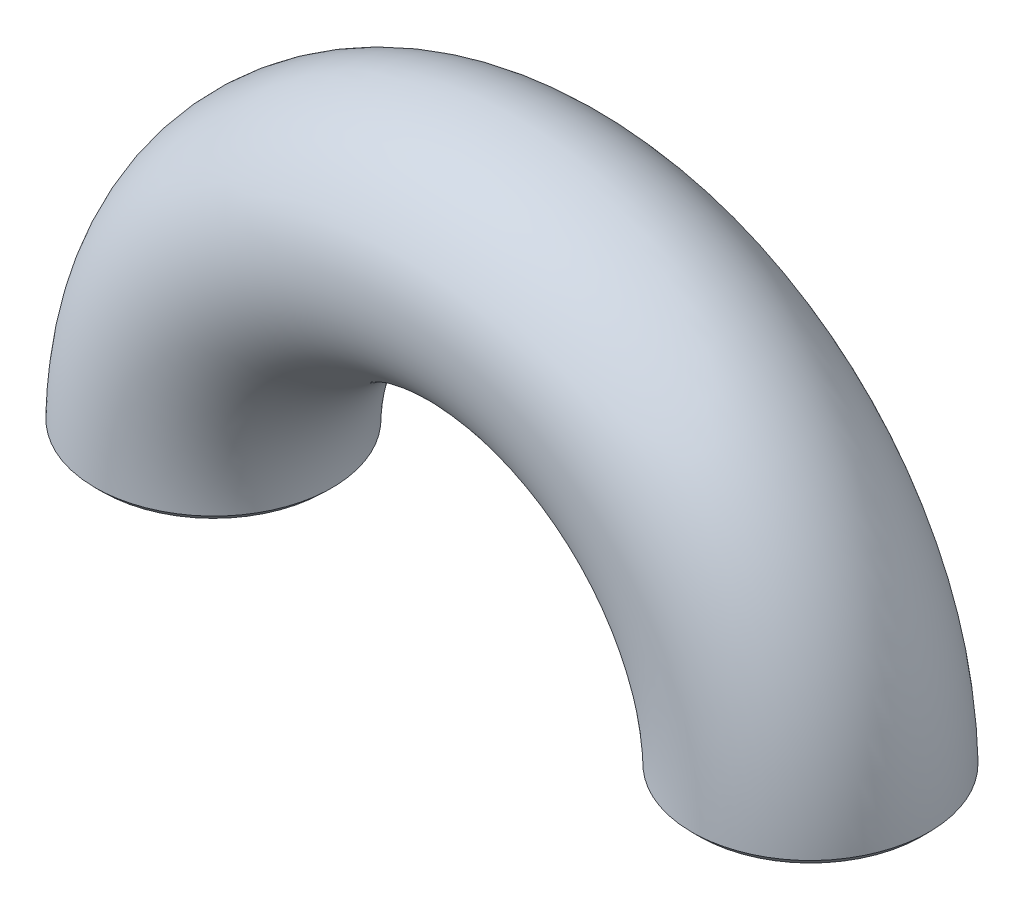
ISO-10303-21;
HEADER;
FILE_DESCRIPTION(('STEP AP214'),'2;1');
FILE_NAME('part.step','',(''),(''),'','','');
FILE_SCHEMA(('AUTOMOTIVE_DESIGN { 1 0 10303 214 1 1 1 1 }'));
ENDSEC;
DATA;
#1=APPLICATION_CONTEXT('core data for automotive mechanical design processes');
#2=APPLICATION_PROTOCOL_DEFINITION('international standard','automotive_design',2000,#1);
#3=PRODUCT_CONTEXT('',#1,'mechanical');
#4=PRODUCT('Part','Part','',(#3));
#5=PRODUCT_RELATED_PRODUCT_CATEGORY('part','',(#4));
#6=PRODUCT_DEFINITION_FORMATION('','',#4);
#7=PRODUCT_DEFINITION_CONTEXT('part definition',#1,'design');
#8=PRODUCT_DEFINITION('design','',#6,#7);
#9=PRODUCT_DEFINITION_SHAPE('','',#8);
#10=(LENGTH_UNIT() NAMED_UNIT(*) SI_UNIT(.MILLI.,.METRE.));
#11=(NAMED_UNIT(*) PLANE_ANGLE_UNIT() SI_UNIT($,.RADIAN.));
#12=(NAMED_UNIT(*) SI_UNIT($,.STERADIAN.) SOLID_ANGLE_UNIT());
#13=UNCERTAINTY_MEASURE_WITH_UNIT(LENGTH_MEASURE(1.E-05),#10,'distance_accuracy_value','');
#14=(GEOMETRIC_REPRESENTATION_CONTEXT(3) GLOBAL_UNCERTAINTY_ASSIGNED_CONTEXT((#13)) GLOBAL_UNIT_ASSIGNED_CONTEXT((#10,
#11,#12)) REPRESENTATION_CONTEXT('',''));
#15=CARTESIAN_POINT('',(0.,0.,0.));
#16=DIRECTION('',(0.,0.,1.));
#17=DIRECTION('',(1.,0.,0.));
#18=AXIS2_PLACEMENT_3D('',#15,#16,#17);
#19=CARTESIAN_POINT('',(0.,0.,0.));
#20=DIRECTION('',(0.,0.,1.));
#21=DIRECTION('',(1.,0.,0.));
#22=AXIS2_PLACEMENT_3D('',#19,#20,#21);
#23=TOROIDAL_SURFACE('',#22,76.2,30.226);
#24=CARTESIAN_POINT('',(76.2014531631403,1.84576853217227,30.225990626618));
#25=CARTESIAN_POINT('',(74.2321868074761,1.84285933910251,30.2284703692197));
#26=CARTESIAN_POINT('',(72.2236360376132,1.83967145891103,30.0321247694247));
#27=CARTESIAN_POINT('',(68.3530641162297,1.83301571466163,29.2619378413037));
#28=CARTESIAN_POINT('',(66.4699355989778,1.8295229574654,28.6939678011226));
#29=CARTESIAN_POINT('',(62.7983053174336,1.82214636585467,27.1786467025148));
#30=CARTESIAN_POINT('',(61.0310895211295,1.81829557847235,26.2342601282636));
#31=CARTESIAN_POINT('',(57.7600465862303,1.81060855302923,24.051030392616));
#32=CARTESIAN_POINT('',(56.2273932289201,1.80671237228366,22.8002170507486));
#33=CARTESIAN_POINT('',(53.4004230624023,1.79901407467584,19.9788931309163));
#34=CARTESIAN_POINT('',(52.148479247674,1.79533135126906,18.4510740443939));
#35=CARTESIAN_POINT('',(49.9583101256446,1.78854206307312,15.18458884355));
#36=CARTESIAN_POINT('',(49.0086837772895,1.78539503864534,13.4154177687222));
#37=CARTESIAN_POINT('',(47.4887305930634,1.78017185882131,9.75144188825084));
#38=CARTESIAN_POINT('',(46.9168019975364,1.77810156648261,7.86971083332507));
#39=CARTESIAN_POINT('',(46.1392532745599,1.77524875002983,3.99557766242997));
#40=CARTESIAN_POINT('',(45.9401774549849,1.77449387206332,1.98869038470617));
#41=CARTESIAN_POINT('',(45.9393197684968,1.77449060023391,-1.94737084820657));
#42=CARTESIAN_POINT('',(46.1273858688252,1.7752042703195,-3.90772846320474));
#43=CARTESIAN_POINT('',(46.9012215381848,1.77804533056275,-7.819685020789));
#44=CARTESIAN_POINT('',(47.4798002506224,1.78014003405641,-9.7231559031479));
#45=CARTESIAN_POINT('',(48.9820775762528,1.78530474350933,-13.3579151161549));
#46=CARTESIAN_POINT('',(49.9171446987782,1.78840992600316,-15.1156753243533));
#47=CARTESIAN_POINT('',(52.1302193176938,1.79527914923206,-18.4311189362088));
#48=CARTESIAN_POINT('',(53.3805544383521,1.79895316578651,-19.9519938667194));
#49=CARTESIAN_POINT('',(56.1599494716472,1.80653535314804,-22.7398002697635));
#50=CARTESIAN_POINT('',(57.717857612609,1.81050712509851,-24.0211618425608));
#51=CARTESIAN_POINT('',(61.0014346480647,1.81822811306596,-26.2161347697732));
#52=CARTESIAN_POINT('',(62.734458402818,1.82200946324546,-27.146027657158));
#53=CARTESIAN_POINT('',(66.3980278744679,1.82938680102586,-28.6703345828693));
#54=CARTESIAN_POINT('',(68.3181734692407,1.83295400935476,-29.2537259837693));
#55=CARTESIAN_POINT('',(72.1747050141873,1.8395889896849,-30.0236336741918));
#56=CARTESIAN_POINT('',(74.1457056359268,1.84272527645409,-30.2218464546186));
#57=CARTESIAN_POINT('',(80.1209385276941,1.85157105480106,-30.2342269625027));
#58=CARTESIAN_POINT('',(84.1075208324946,1.85658485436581,-29.4308875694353));
#59=CARTESIAN_POINT('',(89.5566583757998,1.86275762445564,-27.1766672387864));
#60=CARTESIAN_POINT('',(91.3201630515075,1.86463447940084,-26.2371853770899));
#61=CARTESIAN_POINT('',(94.6291542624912,1.86799350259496,-24.0258500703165));
#62=CARTESIAN_POINT('',(96.1489354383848,1.86945306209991,-22.7761402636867));
#63=CARTESIAN_POINT('',(98.9386900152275,1.87203897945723,-19.9923858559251));
#64=CARTESIAN_POINT('',(100.219949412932,1.87317309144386,-18.432408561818));
#65=CARTESIAN_POINT('',(102.409571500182,1.87506065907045,-15.1526473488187));
#66=CARTESIAN_POINT('',(103.339452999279,1.87583432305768,-13.4190564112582));
#67=CARTESIAN_POINT('',(104.864065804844,1.87708254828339,-9.7463446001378));
#68=CARTESIAN_POINT('',(105.443644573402,1.87754475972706,-7.83188274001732));
#69=CARTESIAN_POINT('',(106.210938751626,1.87815354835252,-3.97442760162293));
#70=CARTESIAN_POINT('',(106.409004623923,1.87830828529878,-2.00318883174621));
#71=CARTESIAN_POINT('',(106.409841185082,1.87830894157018,1.99013995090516));
#72=CARTESIAN_POINT('',(106.213396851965,1.8781554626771,3.95344833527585));
#73=CARTESIAN_POINT('',(105.449360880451,1.87754933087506,7.81174393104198));
#74=CARTESIAN_POINT('',(104.867198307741,1.8770850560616,9.73652488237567));
#75=CARTESIAN_POINT('',(103.349602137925,1.87584268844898,13.3968411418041));
#76=CARTESIAN_POINT('',(102.4225642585,1.87507169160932,15.1312533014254));
#77=CARTESIAN_POINT('',(100.228251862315,1.87318041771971,18.421914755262));
#78=CARTESIAN_POINT('',(98.9497841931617,1.87204890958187,19.9793838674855));
#79=CARTESIAN_POINT('',(96.1664763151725,1.86946966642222,22.7605229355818));
#80=CARTESIAN_POINT('',(94.6459281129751,1.86801016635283,24.0136261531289));
#81=CARTESIAN_POINT('',(91.3292868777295,1.86464410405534,26.2320974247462));
#82=CARTESIAN_POINT('',(89.5764348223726,1.86277951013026,27.1664706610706));
#83=CARTESIAN_POINT('',(85.9435142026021,1.85866518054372,28.6733597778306));
#84=CARTESIAN_POINT('',(84.0361573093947,1.85638363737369,29.25508785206));
#85=CARTESIAN_POINT('',(80.1295863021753,1.85136350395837,30.0325557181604));
#86=CARTESIAN_POINT('',(78.1707195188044,1.84867772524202,30.2235108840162));
#87=CARTESIAN_POINT('',(76.2014531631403,1.84576853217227,30.225990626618));
#88=B_SPLINE_CURVE_WITH_KNOTS('',3,(#24,#25,#26,#27,#28,#29,#30,#31,#32,#33,#34,#35,#36,#37,#38,
#39,#40,#41,#42,#43,#44,#45,#46,#47,#48,#49,#50,#51,#52,#53,#54,#55,#56,#57,#58,#59,#60,#61,#62,
#63,#64,#65,#66,#67,#68,#69,#70,#71,#72,#73,#74,#75,#76,#77,#78,#79,#80,#81,#82,#83,#84,#85,#86,
#87),.UNSPECIFIED.,.T.,.F.,(4,2,2,2,2,2,2,2,2,2,2,2,2,2,2,2,2,2,2,2,2,2,2,2,2,2,2,2,2,2,2,4),
(-0.174454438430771,-0.168908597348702,-0.163362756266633,-0.157816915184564,-0.152271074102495,
-0.146725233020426,-0.141179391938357,-0.135633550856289,-0.13008770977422,-0.124541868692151,
-0.118996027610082,-0.113450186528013,-0.107904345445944,-0.102358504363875,-0.0968126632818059,
-0.091266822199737,-0.0857209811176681,-0.0746292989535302,-0.0690834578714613,
-0.0635376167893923,-0.0579917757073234,-0.0524459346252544,-0.0469000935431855,
-0.0413542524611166,-0.0358084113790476,-0.0302625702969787,-0.0247167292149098,
-0.0191708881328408,-0.0136250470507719,-0.00807920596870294,-0.00253336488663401,
0.00301247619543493),.UNSPECIFIED.);
#89=CARTESIAN_POINT('',(76.2014531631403,1.84576853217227,30.225990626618));
#90=VERTEX_POINT('',#89);
#91=EDGE_CURVE('E46',#90,#90,#88,.F.);
#92=ORIENTED_EDGE('',*,*,#91,.T.);
#93=EDGE_LOOP('',(#92));
#94=FACE_BOUND('',#93,.T.);
#95=CARTESIAN_POINT('',(-76.2014531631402,1.84576853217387,30.225990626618));
#96=CARTESIAN_POINT('',(-76.7119858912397,1.84652317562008,30.2257505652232));
#97=CARTESIAN_POINT('',(-77.2224815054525,1.84726323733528,30.2123069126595));
#98=CARTESIAN_POINT('',(-78.2447368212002,1.84871829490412,30.1594057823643));
#99=CARTESIAN_POINT('',(-78.756489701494,1.8494331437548,30.1198160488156));
#100=CARTESIAN_POINT('',(-79.7773714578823,1.85083419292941,30.0150282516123));
#101=CARTESIAN_POINT('',(-80.2865003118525,1.85152039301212,29.9498299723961));
#102=CARTESIAN_POINT('',(-81.2982038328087,1.85286001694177,29.7937310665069));
#103=CARTESIAN_POINT('',(-81.8007985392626,1.85351358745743,29.7029605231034));
#104=CARTESIAN_POINT('',(-82.7983877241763,1.85478901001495,29.496578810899));
#105=CARTESIAN_POINT('',(-83.2934068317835,1.85541099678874,29.381086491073));
#106=CARTESIAN_POINT('',(-84.2767915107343,1.85662669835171,29.1255109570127));
#107=CARTESIAN_POINT('',(-84.7651603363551,1.85722042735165,28.9854402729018));
#108=CARTESIAN_POINT('',(-85.7353757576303,1.85838130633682,28.680351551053));
#109=CARTESIAN_POINT('',(-86.2172031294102,1.85894838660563,28.5152723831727));
#110=CARTESIAN_POINT('',(-87.174480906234,1.86005790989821,28.1601797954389));
#111=CARTESIAN_POINT('',(-87.6498841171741,1.8606002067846,27.9700391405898));
#112=CARTESIAN_POINT('',(-88.5914044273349,1.86165831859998,27.56527029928));
#113=CARTESIAN_POINT('',(-89.0574985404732,1.86217407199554,27.3505886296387));
#114=CARTESIAN_POINT('',(-89.9776017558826,1.86317773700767,26.8981292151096));
#115=CARTESIAN_POINT('',(-90.4316253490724,1.86366568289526,26.6603809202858));
#116=CARTESIAN_POINT('',(-91.3255964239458,1.86461338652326,26.1630864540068));
#117=CARTESIAN_POINT('',(-91.7655858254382,1.86507323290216,25.9036156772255));
#118=CARTESIAN_POINT('',(-92.6296060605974,1.86596444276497,25.3638210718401));
#119=CARTESIAN_POINT('',(-93.053704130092,1.86639593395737,25.0836048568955));
#120=CARTESIAN_POINT('',(-93.8874190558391,1.86723381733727,24.5022017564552));
#121=CARTESIAN_POINT('',(-94.2970324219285,1.86764020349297,24.2010098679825));
#122=CARTESIAN_POINT('',(-95.1018128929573,1.86842927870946,23.5774120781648));
#123=CARTESIAN_POINT('',(-95.4969314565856,1.86881189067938,23.254943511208));
#124=CARTESIAN_POINT('',(-96.2720979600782,1.86955412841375,22.5888621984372));
#125=CARTESIAN_POINT('',(-96.6520680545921,1.86991364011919,22.2451588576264));
#126=CARTESIAN_POINT('',(-97.3956410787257,1.87060978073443,21.5373905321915));
#127=CARTESIAN_POINT('',(-97.7591673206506,1.87094630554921,21.1732449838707));
#128=CARTESIAN_POINT('',(-98.4653095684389,1.87159360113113,20.4288837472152));
#129=CARTESIAN_POINT('',(-98.8080264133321,1.87190449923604,20.0487637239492));
#130=CARTESIAN_POINT('',(-99.4720045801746,1.87250119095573,19.2734641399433));
#131=CARTESIAN_POINT('',(-99.7933632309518,1.87278710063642,18.8783679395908));
#132=CARTESIAN_POINT('',(-100.414898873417,1.87333529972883,18.0735239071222));
#133=CARTESIAN_POINT('',(-100.715129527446,1.87359764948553,17.6638174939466));
#134=CARTESIAN_POINT('',(-101.295048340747,1.87410054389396,16.8295117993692));
#135=CARTESIAN_POINT('',(-101.574716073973,1.87434106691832,16.4048983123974));
#136=CARTESIAN_POINT('',(-102.113565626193,1.87480114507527,15.5393426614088));
#137=CARTESIAN_POINT('',(-102.372615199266,1.8750205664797,15.0983181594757));
#138=CARTESIAN_POINT('',(-102.868992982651,1.87543823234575,14.202420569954));
#139=CARTESIAN_POINT('',(-103.106250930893,1.87563640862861,13.7475085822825));
#140=CARTESIAN_POINT('',(-103.557324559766,1.87601092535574,12.8263818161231));
#141=CARTESIAN_POINT('',(-103.771147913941,1.87618727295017,12.3601707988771));
#142=CARTESIAN_POINT('',(-104.173777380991,1.87651766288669,11.4191699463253));
#143=CARTESIAN_POINT('',(-104.362675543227,1.87667178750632,10.9444194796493));
#144=CARTESIAN_POINT('',(-104.715629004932,1.87695851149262,9.98803795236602));
#145=CARTESIAN_POINT('',(-104.879785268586,1.8770911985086,9.50644414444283));
#146=CARTESIAN_POINT('',(-105.183244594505,1.87733549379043,8.53616539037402));
#147=CARTESIAN_POINT('',(-105.322579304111,1.87744712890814,8.04749034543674));
#148=CARTESIAN_POINT('',(-105.576771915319,1.87765011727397,7.06292447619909));
#149=CARTESIAN_POINT('',(-105.691587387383,1.87774143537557,6.56702270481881));
#150=CARTESIAN_POINT('',(-105.89652646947,1.87790412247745,5.56763011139));
#151=CARTESIAN_POINT('',(-105.986527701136,1.87797539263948,5.0641141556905));
#152=CARTESIAN_POINT('',(-106.140915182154,1.87809744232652,4.05127968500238));
#153=CARTESIAN_POINT('',(-106.205205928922,1.87814814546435,3.54194663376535));
#154=CARTESIAN_POINT('',(-106.308099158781,1.87822916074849,2.52114438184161));
#155=CARTESIAN_POINT('',(-106.346724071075,1.87825949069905,2.00967744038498));
#156=CARTESIAN_POINT('',(-106.397600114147,1.87829938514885,0.988227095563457));
#157=CARTESIAN_POINT('',(-106.409994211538,1.87830906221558,0.478250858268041));
#158=CARTESIAN_POINT('',(-106.408822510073,1.87830814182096,-0.539259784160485));
#159=CARTESIAN_POINT('',(-106.39537878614,1.87829763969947,-1.04679436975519));
#160=CARTESIAN_POINT('',(-106.34318245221,1.87825670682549,-2.0610155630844));
#161=CARTESIAN_POINT('',(-106.304407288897,1.87822625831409,-2.56770101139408));
#162=CARTESIAN_POINT('',(-106.201022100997,1.87814484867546,-3.58030744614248));
#163=CARTESIAN_POINT('',(-106.136318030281,1.87809381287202,-4.08621884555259));
#164=CARTESIAN_POINT('',(-105.98090720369,1.87797094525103,-5.09733314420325));
#165=CARTESIAN_POINT('',(-105.890037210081,1.87789898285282,-5.60251093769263));
#166=CARTESIAN_POINT('',(-105.682650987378,1.87773433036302,-6.60785984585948));
#167=CARTESIAN_POINT('',(-105.566120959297,1.87764162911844,-7.10802811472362));
#168=CARTESIAN_POINT('',(-105.30821050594,1.87743561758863,-8.09984952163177));
#169=CARTESIAN_POINT('',(-105.166927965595,1.87732238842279,-8.59152811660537));
#170=CARTESIAN_POINT('',(-104.860174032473,1.87707537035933,-9.56535589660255));
#171=CARTESIAN_POINT('',(-104.694790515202,1.87694165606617,-10.0475327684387));
#172=CARTESIAN_POINT('',(-104.340444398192,1.87665367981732,-11.0014589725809));
#173=CARTESIAN_POINT('',(-104.151555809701,1.87649948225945,-11.4732357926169));
#174=CARTESIAN_POINT('',(-103.749727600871,1.87616961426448,-12.4076040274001));
#175=CARTESIAN_POINT('',(-103.536738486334,1.8759938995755,-12.8701741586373));
#176=CARTESIAN_POINT('',(-103.086868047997,1.87562026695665,-13.7856751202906));
#177=CARTESIAN_POINT('',(-102.849901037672,1.87542226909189,-14.238563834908));
#178=CARTESIAN_POINT('',(-102.352582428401,1.87500364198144,-15.1332007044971));
#179=CARTESIAN_POINT('',(-102.092158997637,1.87478294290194,-15.5749089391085));
#180=CARTESIAN_POINT('',(-101.548579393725,1.8743186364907,-16.4453064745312));
#181=CARTESIAN_POINT('',(-101.265379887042,1.87407498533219,-16.873968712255));
#182=CARTESIAN_POINT('',(-100.679126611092,1.87356627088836,-17.714135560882));
#183=CARTESIAN_POINT('',(-100.376185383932,1.87330132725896,-18.1257187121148));
#184=CARTESIAN_POINT('',(-99.7512092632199,1.87274958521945,-18.931057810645));
#185=CARTESIAN_POINT('',(-99.4292699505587,1.87246289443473,-19.3248879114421));
#186=CARTESIAN_POINT('',(-98.7664801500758,1.87186676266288,-20.095083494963));
#187=CARTESIAN_POINT('',(-98.4256638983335,1.87155736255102,-20.4714784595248));
#188=CARTESIAN_POINT('',(-97.7250850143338,1.87091478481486,-21.207576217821));
#189=CARTESIAN_POINT('',(-97.3652876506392,1.87058156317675,-21.567245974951));
#190=CARTESIAN_POINT('',(-96.625208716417,1.86988832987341,-22.2699427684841));
#191=CARTESIAN_POINT('',(-96.2448065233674,1.86952815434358,-22.6128427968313));
#192=CARTESIAN_POINT('',(-95.4661668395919,1.86878214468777,-23.2800299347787));
#193=CARTESIAN_POINT('',(-95.067882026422,1.86839624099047,-23.6042617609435));
#194=CARTESIAN_POINT('',(-94.2562989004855,1.8675999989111,-24.2315286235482));
#195=CARTESIAN_POINT('',(-93.8430344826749,1.86718971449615,-24.5346074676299));
#196=CARTESIAN_POINT('',(-93.0038353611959,1.8663454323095,-25.1172818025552));
#197=CARTESIAN_POINT('',(-92.5779883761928,1.86591158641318,-25.3970036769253));
#198=CARTESIAN_POINT('',(-91.7140431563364,1.86501946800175,-25.9341439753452));
#199=CARTESIAN_POINT('',(-91.2759808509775,1.86456126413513,-26.1916202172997));
#200=CARTESIAN_POINT('',(-90.3871459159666,1.86361815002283,-26.6842092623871));
#201=CARTESIAN_POINT('',(-89.9363666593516,1.86313322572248,-26.9193101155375));
#202=CARTESIAN_POINT('',(-89.0219110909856,1.86213482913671,-27.3672574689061));
#203=CARTESIAN_POINT('',(-88.5581948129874,1.86162126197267,-27.5800223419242));
#204=CARTESIAN_POINT('',(-87.618360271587,1.86056436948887,-27.9828675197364));
#205=CARTESIAN_POINT('',(-87.1421930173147,1.8600209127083,-28.1728335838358));
#206=CARTESIAN_POINT('',(-86.1803751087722,1.85890529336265,-28.5282793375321));
#207=CARTESIAN_POINT('',(-85.6947171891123,1.85833310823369,-28.6937393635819));
#208=CARTESIAN_POINT('',(-84.7166275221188,1.85716169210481,-28.9996489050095));
#209=CARTESIAN_POINT('',(-84.2242107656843,1.8565625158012,-29.140146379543));
#210=CARTESIAN_POINT('',(-83.2351537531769,1.85533839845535,-29.395374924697));
#211=CARTESIAN_POINT('',(-82.7385433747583,1.85471358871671,-29.5102216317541));
#212=CARTESIAN_POINT('',(-81.7417834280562,1.85343715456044,-29.7140186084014));
#213=CARTESIAN_POINT('',(-81.2416514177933,1.85278562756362,-29.8030548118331));
#214=CARTESIAN_POINT('',(-80.2363916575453,1.85145259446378,-29.9561339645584));
#215=CARTESIAN_POINT('',(-79.7312550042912,1.85077102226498,-30.020118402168));
#216=CARTESIAN_POINT('',(-78.7167031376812,1.84937697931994,-30.1227319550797));
#217=CARTESIAN_POINT('',(-78.2072792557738,1.8486644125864,-30.1612752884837));
#218=CARTESIAN_POINT('',(-77.1849313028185,1.84720818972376,-30.213002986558));
#219=CARTESIAN_POINT('',(-76.6720016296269,1.84646441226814,-30.2260767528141));
#220=CARTESIAN_POINT('',(-75.6449329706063,1.84494553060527,-30.2259116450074));
#221=CARTESIAN_POINT('',(-75.1307939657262,1.84417035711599,-30.2126110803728));
#222=CARTESIAN_POINT('',(-74.10413715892,1.84259059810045,-30.1593174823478));
#223=CARTESIAN_POINT('',(-73.5916187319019,1.84178602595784,-30.1193364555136));
#224=CARTESIAN_POINT('',(-72.5696950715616,1.84014983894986,-30.0133534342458));
#225=CARTESIAN_POINT('',(-72.0602877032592,1.8393182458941,-29.9473719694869));
#226=CARTESIAN_POINT('',(-71.0460846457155,1.83762977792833,-29.7898098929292));
#227=CARTESIAN_POINT('',(-70.5412840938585,1.83677293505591,-29.6982605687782));
#228=CARTESIAN_POINT('',(-69.5377923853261,1.83503589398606,-29.4900503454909));
#229=CARTESIAN_POINT('',(-69.0390922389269,1.83415573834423,-29.3734327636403));
#230=CARTESIAN_POINT('',(-68.0493036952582,1.83237393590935,-29.1155477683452));
#231=CARTESIAN_POINT('',(-67.5582006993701,1.83147234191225,-28.9743363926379));
#232=CARTESIAN_POINT('',(-66.5851000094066,1.82964960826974,-28.6677550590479));
#233=CARTESIAN_POINT('',(-66.1030806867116,1.82872853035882,-28.502453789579));
#234=CARTESIAN_POINT('',(-65.149530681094,1.82686822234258,-28.1480323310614));
#235=CARTESIAN_POINT('',(-64.6779727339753,1.82592905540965,-27.958985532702));
#236=CARTESIAN_POINT('',(-63.7436668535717,1.82402904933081,-27.5565124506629));
#237=CARTESIAN_POINT('',(-63.2809503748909,1.82306815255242,-27.3430131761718));
#238=CARTESIAN_POINT('',(-62.3649161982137,1.82112731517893,-26.892060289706));
#239=CARTESIAN_POINT('',(-61.9116464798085,1.82014731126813,-26.6545092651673));
#240=CARTESIAN_POINT('',(-61.0165630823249,1.81817324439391,-26.1562318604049));
#241=CARTESIAN_POINT('',(-60.5747803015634,1.81717915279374,-25.89544994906));
#242=CARTESIAN_POINT('',(-59.7050325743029,1.81518236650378,-25.3515403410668));
#243=CARTESIAN_POINT('',(-59.2770712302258,1.81417966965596,-25.0684068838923));
#244=CARTESIAN_POINT('',(-58.438248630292,1.81217523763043,-24.4823629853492));
#245=CARTESIAN_POINT('',(-58.0273095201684,1.81117352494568,-24.1795639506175));
#246=CARTESIAN_POINT('',(-57.2229315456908,1.80917502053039,-23.5547340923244));
#247=CARTESIAN_POINT('',(-56.8294296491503,1.80817822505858,-23.2327844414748));
#248=CARTESIAN_POINT('',(-56.0595798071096,1.80619167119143,-22.5697471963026));
#249=CARTESIAN_POINT('',(-55.6832153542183,1.805201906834,-22.2286787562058));
#250=CARTESIAN_POINT('',(-54.9469437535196,1.80323057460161,-21.5273433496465));
#251=CARTESIAN_POINT('',(-54.5870818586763,1.80224903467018,-21.167028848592));
#252=CARTESIAN_POINT('',(-53.8841463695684,1.8002972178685,-20.4260100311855));
#253=CARTESIAN_POINT('',(-53.5411940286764,1.7993270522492,-20.045190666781));
#254=CARTESIAN_POINT('',(-52.8741280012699,1.79740860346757,-19.2659489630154));
#255=CARTESIAN_POINT('',(-52.5500577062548,1.79646037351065,-18.8674895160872));
#256=CARTESIAN_POINT('',(-51.9233585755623,1.79459737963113,-18.0558738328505));
#257=CARTESIAN_POINT('',(-51.6206704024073,1.79368252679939,-17.642763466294));
#258=CARTESIAN_POINT('',(-51.0389346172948,1.79189663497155,-16.804114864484));
#259=CARTESIAN_POINT('',(-50.7597488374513,1.79102535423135,-16.3786724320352));
#260=CARTESIAN_POINT('',(-50.2233941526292,1.78932830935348,-15.5152579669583));
#261=CARTESIAN_POINT('',(-49.9661843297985,1.788502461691,-15.0773113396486));
#262=CARTESIAN_POINT('',(-49.4738932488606,1.78690120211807,-14.188321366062));
#263=CARTESIAN_POINT('',(-49.2388442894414,1.78612586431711,-13.7372601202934));
#264=CARTESIAN_POINT('',(-48.7908600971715,1.78463036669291,-12.8218037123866));
#265=CARTESIAN_POINT('',(-48.5780278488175,1.78391046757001,-12.3573581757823));
#266=CARTESIAN_POINT('',(-48.1751392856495,1.78253303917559,-11.4160587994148));
#267=CARTESIAN_POINT('',(-47.9851967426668,1.78187582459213,-10.9391562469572));
#268=CARTESIAN_POINT('',(-47.6301402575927,1.7806359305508,-9.97672730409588));
#269=CARTESIAN_POINT('',(-47.4650022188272,1.78005317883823,-9.49120980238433));
#270=CARTESIAN_POINT('',(-47.1599121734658,1.77896752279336,-8.51374627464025));
#271=CARTESIAN_POINT('',(-47.0198942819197,1.77846441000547,-8.02182080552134));
#272=CARTESIAN_POINT('',(-46.7655445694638,1.77754402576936,-7.03354856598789));
#273=CARTESIAN_POINT('',(-46.6511084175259,1.77712640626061,-6.5372286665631));
#274=CARTESIAN_POINT('',(-46.4478568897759,1.77638133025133,-5.54063769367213));
#275=CARTESIAN_POINT('',(-46.3589795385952,1.77605365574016,-5.04037925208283));
#276=CARTESIAN_POINT('',(-46.2062127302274,1.77548849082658,-4.03469772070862));
#277=CARTESIAN_POINT('',(-46.1423905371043,1.77525124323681,-3.52926441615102));
#278=CARTESIAN_POINT('',(-46.0402105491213,1.77487011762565,-2.51389544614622));
#279=CARTESIAN_POINT('',(-46.0019499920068,1.77472659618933,-2.00394998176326));
#280=CARTESIAN_POINT('',(-45.9512749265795,1.77453599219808,-0.980271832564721));
#281=CARTESIAN_POINT('',(-45.9389880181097,1.77448938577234,-0.466532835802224));
#282=CARTESIAN_POINT('',(-45.9405678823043,1.77449530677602,0.560319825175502));
#283=CARTESIAN_POINT('',(-45.9544049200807,1.77454772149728,1.07343353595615));
#284=CARTESIAN_POINT('',(-46.0080762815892,1.7747494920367,2.09511132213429));
#285=CARTESIAN_POINT('',(-46.0477488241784,1.77489824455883,2.60368387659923));
#286=CARTESIAN_POINT('',(-46.1527287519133,1.77528965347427,3.61629297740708));
#287=CARTESIAN_POINT('',(-46.2179420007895,1.77553196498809,4.12033930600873));
#288=CARTESIAN_POINT('',(-46.3733158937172,1.77610654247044,5.12401175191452));
#289=CARTESIAN_POINT('',(-46.4634493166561,1.77643871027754,5.62364208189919));
#290=CARTESIAN_POINT('',(-46.6695439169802,1.77719373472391,6.62014871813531));
#291=CARTESIAN_POINT('',(-46.7856314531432,1.7776170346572,7.11699892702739));
#292=CARTESIAN_POINT('',(-47.0434721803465,1.77854920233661,8.10660956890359));
#293=CARTESIAN_POINT('',(-47.1853494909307,1.77905848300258,8.5993376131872));
#294=CARTESIAN_POINT('',(-47.4938419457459,1.78015513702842,9.5775185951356));
#295=CARTESIAN_POINT('',(-47.6604809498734,1.78074258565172,10.0629640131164));
#296=CARTESIAN_POINT('',(-48.0179965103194,1.78198958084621,11.023229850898));
#297=CARTESIAN_POINT('',(-48.2088006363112,1.78264891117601,11.4980772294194));
#298=CARTESIAN_POINT('',(-48.6132232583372,1.78402980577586,12.4353028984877));
#299=CARTESIAN_POINT('',(-48.8267303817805,1.78475106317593,12.8977292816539));
#300=CARTESIAN_POINT('',(-49.276315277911,1.78624996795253,13.8101931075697));
#301=CARTESIAN_POINT('',(-49.5123413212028,1.7870274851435,14.2602560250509));
#302=CARTESIAN_POINT('',(-50.0070666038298,1.78863437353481,15.148186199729));
#303=CARTESIAN_POINT('',(-50.2657829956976,1.78946378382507,15.5860438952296));
#304=CARTESIAN_POINT('',(-50.8057628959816,1.79116950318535,16.449927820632));
#305=CARTESIAN_POINT('',(-51.0871076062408,1.79204597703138,16.8759033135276));
#306=CARTESIAN_POINT('',(-51.6726409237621,1.7938402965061,17.7147530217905));
#307=CARTESIAN_POINT('',(-51.9769279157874,1.79475831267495,18.1275585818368));
#308=CARTESIAN_POINT('',(-52.6062201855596,1.79662547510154,18.9376241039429));
#309=CARTESIAN_POINT('',(-52.9312432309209,1.79757464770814,19.3348702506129));
#310=CARTESIAN_POINT('',(-53.5997915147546,1.79949352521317,20.1111740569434));
#311=CARTESIAN_POINT('',(-53.9432510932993,1.80046315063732,20.4902882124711));
#312=CARTESIAN_POINT('',(-54.6470200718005,1.80241332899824,21.2279179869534));
#313=CARTESIAN_POINT('',(-55.0072077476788,1.80339377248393,21.5865497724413));
#314=CARTESIAN_POINT('',(-55.7446168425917,1.80536420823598,22.2851122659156));
#315=CARTESIAN_POINT('',(-56.1218215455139,1.80635419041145,22.6250606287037));
#316=CARTESIAN_POINT('',(-56.8938825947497,1.80834242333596,23.2863440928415));
#317=CARTESIAN_POINT('',(-57.2887813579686,1.80934068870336,23.6076297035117));
#318=CARTESIAN_POINT('',(-58.0964510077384,1.81134308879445,24.2313969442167));
#319=CARTESIAN_POINT('',(-58.5093043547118,1.81234722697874,24.5337717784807));
#320=CARTESIAN_POINT('',(-59.351900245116,1.8143560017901,25.1187163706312));
#321=CARTESIAN_POINT('',(-59.7817174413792,1.81536061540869,25.4011785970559));
#322=CARTESIAN_POINT('',(-60.6535377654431,1.81735731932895,25.9427554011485));
#323=CARTESIAN_POINT('',(-61.0954879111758,1.81834944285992,26.2019552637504));
#324=CARTESIAN_POINT('',(-61.990193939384,1.82031787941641,26.6965781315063));
#325=CARTESIAN_POINT('',(-62.4428996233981,1.82129423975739,26.9320919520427));
#326=CARTESIAN_POINT('',(-63.358139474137,1.8232287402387,27.3792421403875));
#327=CARTESIAN_POINT('',(-63.8206371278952,1.82418692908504,27.5909532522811));
#328=CARTESIAN_POINT('',(-64.7554651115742,1.82608444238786,27.9907034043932));
#329=CARTESIAN_POINT('',(-65.2277901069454,1.82702377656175,28.1787549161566));
#330=CARTESIAN_POINT('',(-66.1833360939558,1.82888590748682,28.5314366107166));
#331=CARTESIAN_POINT('',(-66.666594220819,1.82980861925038,28.6959661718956));
#332=CARTESIAN_POINT('',(-67.6424039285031,1.83163487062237,29.0009776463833));
#333=CARTESIAN_POINT('',(-68.1349810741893,1.83253833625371,29.1413777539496));
#334=CARTESIAN_POINT('',(-69.1277747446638,1.83432303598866,29.3972811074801));
#335=CARTESIAN_POINT('',(-69.6280062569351,1.83520421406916,29.5127262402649));
#336=CARTESIAN_POINT('',(-70.6327427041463,1.83693872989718,29.717767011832));
#337=CARTESIAN_POINT('',(-71.1372376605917,1.83779211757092,29.8074115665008));
#338=CARTESIAN_POINT('',(-72.147213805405,1.83946736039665,29.9605657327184));
#339=CARTESIAN_POINT('',(-72.6526726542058,1.84028936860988,30.0242226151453));
#340=CARTESIAN_POINT('',(-73.6647142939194,1.8419036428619,30.1256539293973));
#341=CARTESIAN_POINT('',(-74.1712897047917,1.84269598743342,30.1635020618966));
#342=CARTESIAN_POINT('',(-75.185734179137,1.84425307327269,30.2137752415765));
#343=CARTESIAN_POINT('',(-75.693603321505,1.84501781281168,30.2261986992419));
#344=CARTESIAN_POINT('',(-76.2014531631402,1.84576853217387,30.225990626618));
#345=B_SPLINE_CURVE_WITH_KNOTS('',3,(#95,#96,#97,#98,#99,#100,#101,#102,#103,#104,#105,#106,
#107,#108,#109,#110,#111,#112,#113,#114,#115,#116,#117,#118,#119,#120,#121,#122,#123,#124,#125,
#126,#127,#128,#129,#130,#131,#132,#133,#134,#135,#136,#137,#138,#139,#140,#141,#142,#143,#144,
#145,#146,#147,#148,#149,#150,#151,#152,#153,#154,#155,#156,#157,#158,#159,#160,#161,#162,#163,
#164,#165,#166,#167,#168,#169,#170,#171,#172,#173,#174,#175,#176,#177,#178,#179,#180,#181,#182,
#183,#184,#185,#186,#187,#188,#189,#190,#191,#192,#193,#194,#195,#196,#197,#198,#199,#200,#201,
#202,#203,#204,#205,#206,#207,#208,#209,#210,#211,#212,#213,#214,#215,#216,#217,#218,#219,#220,
#221,#222,#223,#224,#225,#226,#227,#228,#229,#230,#231,#232,#233,#234,#235,#236,#237,#238,#239,
#240,#241,#242,#243,#244,#245,#246,#247,#248,#249,#250,#251,#252,#253,#254,#255,#256,#257,#258,
#259,#260,#261,#262,#263,#264,#265,#266,#267,#268,#269,#270,#271,#272,#273,#274,#275,#276,#277,
#278,#279,#280,#281,#282,#283,#284,#285,#286,#287,#288,#289,#290,#291,#292,#293,#294,#295,#296,
#297,#298,#299,#300,#301,#302,#303,#304,#305,#306,#307,#308,#309,#310,#311,#312,#313,#314,#315,
#316,#317,#318,#319,#320,#321,#322,#323,#324,#325,#326,#327,#328,#329,#330,#331,#332,#333,#334,
#335,#336,#337,#338,#339,#340,#341,#342,#343,#344),.UNSPECIFIED.,.F.,.F.,(4,2,2,2,2,2,2,2,2,2,2,
2,2,2,2,2,2,2,2,2,2,2,2,2,2,2,2,2,2,2,2,2,2,2,2,2,2,2,2,2,2,2,2,2,2,2,2,2,2,2,2,2,2,2,2,2,2,2,2,
2,2,2,2,2,2,2,2,2,2,2,2,2,2,2,2,2,2,2,2,2,2,2,2,2,2,2,2,2,2,2,2,2,2,2,2,2,2,2,2,2,2,2,2,2,2,2,2,
2,2,2,2,2,2,2,2,2,2,2,2,2,2,2,2,2,4),(0.,1.53138243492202,3.07057107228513,4.60977266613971,
6.14128166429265,7.66558703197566,9.18911755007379,10.7164341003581,12.2518270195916,
13.7906322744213,15.3274981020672,16.8592349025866,18.3835183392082,19.9081665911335,
21.4375252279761,22.9739319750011,24.5168891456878,26.0516481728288,27.5788507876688,
29.1020229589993,30.62668827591,32.1604543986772,33.6990038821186,35.2370480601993,
36.7692429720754,38.2950055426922,39.8188086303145,41.3452276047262,42.8790451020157,
44.4185082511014,45.9566242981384,47.4863352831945,49.0088366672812,50.5326954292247,
52.0621321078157,53.6013250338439,55.1413477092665,56.6754123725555,58.2040174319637,
59.7279256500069,61.255022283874,62.787782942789,64.3254083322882,65.8660317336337,
67.3985330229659,68.9238910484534,70.4465678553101,71.972134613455,73.5078768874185,
75.0479550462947,76.584742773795,78.1125882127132,79.6363350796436,81.1608912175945,
82.6908379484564,84.2281564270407,85.7667018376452,87.3022585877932,88.8307465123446,
90.3540854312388,91.8809613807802,93.4129596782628,94.9515957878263,96.493835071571,
98.0353807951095,99.575711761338,101.114166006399,102.649982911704,104.182345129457,
105.710420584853,107.233884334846,108.762020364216,110.296613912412,111.834979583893,
113.373743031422,114.904443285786,116.429063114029,117.952181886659,119.479254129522,
121.016033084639,122.556214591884,124.091938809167,125.617891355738,127.140937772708,
128.66617073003,130.198186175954,131.737527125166,133.275362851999,134.80910423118,
136.336471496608,137.860103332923,139.387798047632,140.921271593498,142.462261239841,
144.001497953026,145.531187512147,147.0552913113,148.577736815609,150.107762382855,
151.645356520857,153.184441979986,154.719018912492,156.246387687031,157.770328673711,
159.295431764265,160.826275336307,162.364104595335,163.903269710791,165.437276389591,
166.961478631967,168.484214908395,170.010820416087,171.545386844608,173.087689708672,
174.624085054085,176.154345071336,177.679657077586,179.204161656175,180.735004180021,
182.270938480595,183.810411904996,185.346947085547,186.87464970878,188.397971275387,
189.921388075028),.UNSPECIFIED.);
#346=CARTESIAN_POINT('',(-76.2014531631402,1.84576853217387,30.225990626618));
#347=VERTEX_POINT('',#346);
#348=EDGE_CURVE('E51',#347,#347,#345,.F.);
#349=ORIENTED_EDGE('',*,*,#348,.T.);
#350=EDGE_LOOP('',(#349));
#351=FACE_BOUND('',#350,.T.);
#352=ADVANCED_FACE('F34',(#94,#351),#23,.T.);
#353=CARTESIAN_POINT('',(76.2,-1.58112928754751E-12,0.));
#354=DIRECTION('',(0.,-1.,0.));
#355=DIRECTION('',(0.,0.,1.));
#356=AXIS2_PLACEMENT_3D('',#353,#354,#355);
#357=PLANE('',#356);
#358=CARTESIAN_POINT('',(76.2,-1.62416207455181E-12,28.3802578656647));
#359=CARTESIAN_POINT('',(76.6767611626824,-1.63406735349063E-12,28.3797016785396));
#360=CARTESIAN_POINT('',(77.1535217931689,-1.64397476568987E-12,28.3672910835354));
#361=CARTESIAN_POINT('',(78.1058973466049,-1.66376590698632E-12,28.3186025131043));
#362=CARTESIAN_POINT('',(78.5815120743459,-1.67364963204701E-12,28.2823207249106));
#363=CARTESIAN_POINT('',(79.5317552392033,-1.69339254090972E-12,28.1855829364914));
#364=CARTESIAN_POINT('',(80.0063761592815,-1.70325155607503E-12,28.1250530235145));
#365=CARTESIAN_POINT('',(80.9547703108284,-1.7229262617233E-12,27.9796937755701));
#366=CARTESIAN_POINT('',(81.4285217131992,-1.73274134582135E-12,27.8947220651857));
#367=CARTESIAN_POINT('',(82.3718562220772,-1.75231162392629E-12,27.700623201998));
#368=CARTESIAN_POINT('',(82.8414312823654,-1.76206669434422E-12,27.5914569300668));
#369=CARTESIAN_POINT('',(83.7731776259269,-1.78145493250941E-12,27.3496773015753));
#370=CARTESIAN_POINT('',(84.2353652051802,-1.79108835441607E-12,27.217126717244));
#371=CARTESIAN_POINT('',(85.1508970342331,-1.81017652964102E-12,26.9293038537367));
#372=CARTESIAN_POINT('',(85.6042658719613,-1.81963177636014E-12,26.7741097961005));
#373=CARTESIAN_POINT('',(86.500779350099,-1.83831394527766E-12,26.4415561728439));
#374=CARTESIAN_POINT('',(86.9439571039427,-1.84754161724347E-12,26.264285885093));
#375=CARTESIAN_POINT('',(87.8211840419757,-1.86577926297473E-12,25.8874717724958));
#376=CARTESIAN_POINT('',(88.2552251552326,-1.87478904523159E-12,25.6879091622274));
#377=CARTESIAN_POINT('',(89.1141435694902,-1.89260574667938E-12,25.2664767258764));
#378=CARTESIAN_POINT('',(89.5389853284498,-1.901411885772E-12,25.0445344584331));
#379=CARTESIAN_POINT('',(90.3785125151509,-1.91881104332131E-12,24.5785354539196));
#380=CARTESIAN_POINT('',(90.7931523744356,-1.92740310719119E-12,24.3343966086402));
#381=CARTESIAN_POINT('',(91.6108910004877,-1.94435872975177E-12,23.8244417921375));
#382=CARTESIAN_POINT('',(92.0139444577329,-1.95272138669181E-12,23.5585531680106));
#383=CARTESIAN_POINT('',(92.8039829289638,-1.9691297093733E-12,23.0080325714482));
#384=CARTESIAN_POINT('',(93.1910395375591,-1.97717677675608E-12,22.7235033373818));
#385=CARTESIAN_POINT('',(93.948211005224,-1.99292498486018E-12,22.1365999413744));
#386=CARTESIAN_POINT('',(94.3184025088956,-2.00062768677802E-12,21.8343246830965));
#387=CARTESIAN_POINT('',(95.0421491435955,-2.01568610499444E-12,21.2121887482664));
#388=CARTESIAN_POINT('',(95.3957420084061,-2.02304260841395E-12,20.8923719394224));
#389=CARTESIAN_POINT('',(96.0870049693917,-2.03741238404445E-12,20.2351741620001));
#390=CARTESIAN_POINT('',(96.4246560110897,-2.04442524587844E-12,19.897773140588));
#391=CARTESIAN_POINT('',(97.0843463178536,-2.05812960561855E-12,19.2038168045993));
#392=CARTESIAN_POINT('',(97.4062689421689,-2.06481869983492E-12,18.8471505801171));
#393=CARTESIAN_POINT('',(98.032797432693,-2.0778307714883E-12,18.1169050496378));
#394=CARTESIAN_POINT('',(98.3373432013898,-2.08415247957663E-12,17.7432742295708));
#395=CARTESIAN_POINT('',(98.9268269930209,-2.09637522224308E-12,16.9815346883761));
#396=CARTESIAN_POINT('',(99.2117874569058,-2.10227673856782E-12,16.5934433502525));
#397=CARTESIAN_POINT('',(99.7599456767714,-2.11360790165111E-12,15.8049889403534));
#398=CARTESIAN_POINT('',(100.023242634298,-2.11903970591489E-12,15.4046948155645));
#399=CARTESIAN_POINT('',(100.528581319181,-2.12949995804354E-12,14.5928645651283));
#400=CARTESIAN_POINT('',(100.770694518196,-2.13452975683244E-12,14.1813729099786));
#401=CARTESIAN_POINT('',(101.233655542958,-2.14415815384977E-12,13.3468431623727));
#402=CARTESIAN_POINT('',(101.454513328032,-2.14875695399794E-12,12.9238105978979));
#403=CARTESIAN_POINT('',(101.875162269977,-2.15751430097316E-12,12.0660695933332));
#404=CARTESIAN_POINT('',(102.07489847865,-2.16167169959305E-12,11.6313342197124));
#405=CARTESIAN_POINT('',(102.453124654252,-2.16953049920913E-12,10.7502622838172));
#406=CARTESIAN_POINT('',(102.631509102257,-2.17322963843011E-12,10.3038803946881));
#407=CARTESIAN_POINT('',(102.965562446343,-2.18016718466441E-12,9.40144130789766));
#408=CARTESIAN_POINT('',(103.121173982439,-2.18340442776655E-12,8.94536288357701));
#409=CARTESIAN_POINT('',(103.409070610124,-2.18939557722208E-12,8.02650509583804));
#410=CARTESIAN_POINT('',(103.541383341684,-2.19215005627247E-12,7.56373438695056));
#411=CARTESIAN_POINT('',(103.781692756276,-2.19715306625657E-12,6.63432542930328));
#412=CARTESIAN_POINT('',(103.889805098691,-2.1994040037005E-12,6.16771712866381));
#413=CARTESIAN_POINT('',(104.081592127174,-2.203394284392E-12,5.23180203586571));
#414=CARTESIAN_POINT('',(104.165379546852,-2.20513598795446E-12,4.76251831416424));
#415=CARTESIAN_POINT('',(104.309583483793,-2.20813321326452E-12,3.8197566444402));
#416=CARTESIAN_POINT('',(104.369969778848,-2.20938810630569E-12,3.34627407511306));
#417=CARTESIAN_POINT('',(104.466853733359,-2.21140179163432E-12,2.39507682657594));
#418=CARTESIAN_POINT('',(104.503261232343,-2.21215871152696E-12,1.91735294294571));
#419=CARTESIAN_POINT('',(104.551955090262,-2.2131709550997E-12,0.957714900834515));
#420=CARTESIAN_POINT('',(104.56409071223,-2.21342314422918E-12,0.475793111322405));
#421=CARTESIAN_POINT('',(104.563863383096,-2.2134256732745E-12,-0.488459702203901));
#422=CARTESIAN_POINT('',(104.551479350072,-2.21317558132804E-12,-0.970790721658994));
#423=CARTESIAN_POINT('',(104.502228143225,-2.21217218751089E-12,-1.93171271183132));
#424=CARTESIAN_POINT('',(104.465487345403,-2.21142148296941E-12,-2.41031015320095));
#425=CARTESIAN_POINT('',(104.367931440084,-2.20941710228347E-12,-3.36320205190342));
#426=CARTESIAN_POINT('',(104.307208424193,-2.20816534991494E-12,-3.8375059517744));
#427=CARTESIAN_POINT('',(104.1622182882,-2.20515664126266E-12,-4.78130957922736));
#428=CARTESIAN_POINT('',(104.078009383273,-2.20340093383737E-12,-5.25081824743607));
#429=CARTESIAN_POINT('',(103.885623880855,-2.19938983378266E-12,-6.18627568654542));
#430=CARTESIAN_POINT('',(103.777380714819,-2.19713305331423E-12,-6.65221077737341));
#431=CARTESIAN_POINT('',(103.536955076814,-2.19213068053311E-12,-7.57999702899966));
#432=CARTESIAN_POINT('',(103.404671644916,-2.18938302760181E-12,-8.04182200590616));
#433=CARTESIAN_POINT('',(103.116626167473,-2.1834036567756E-12,-8.95935188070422));
#434=CARTESIAN_POINT('',(102.960806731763,-2.18017075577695E-12,-9.41503876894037));
#435=CARTESIAN_POINT('',(102.625976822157,-2.17323465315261E-12,-10.3180728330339));
#436=CARTESIAN_POINT('',(102.446954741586,-2.16953121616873E-12,-10.7654157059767));
#437=CARTESIAN_POINT('',(102.067353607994,-2.16165422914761E-12,-11.6483211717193));
#438=CARTESIAN_POINT('',(101.866881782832,-2.1574830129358E-12,-12.0839298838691));
#439=CARTESIAN_POINT('',(101.444976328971,-2.14869193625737E-12,-12.9426093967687));
#440=CARTESIAN_POINT('',(101.223634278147,-2.1440740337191E-12,-13.3657251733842));
#441=CARTESIAN_POINT('',(100.760081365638,-2.13440579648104E-12,-14.1996937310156));
#442=CARTESIAN_POINT('',(100.517895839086,-2.12935598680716E-12,-14.6105606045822));
#443=CARTESIAN_POINT('',(100.012881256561,-2.11884424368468E-12,-15.4206237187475));
#444=CARTESIAN_POINT('',(99.7500094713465,-2.11338145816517E-12,-15.8197933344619));
#445=CARTESIAN_POINT('',(99.2023623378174,-2.10202015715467E-12,-16.6065586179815));
#446=CARTESIAN_POINT('',(98.9174594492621,-2.09611911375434E-12,-16.9940655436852));
#447=CARTESIAN_POINT('',(98.327697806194,-2.08390845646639E-12,-17.7552548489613));
#448=CARTESIAN_POINT('',(98.0227869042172,-2.07759777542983E-12,-18.1288967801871));
#449=CARTESIAN_POINT('',(97.3952720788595,-2.06460558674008E-12,-18.8594822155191));
#450=CARTESIAN_POINT('',(97.072712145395,-2.05792500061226E-12,-19.216463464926));
#451=CARTESIAN_POINT('',(96.4116711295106,-2.04421706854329E-12,-19.9109913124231));
#452=CARTESIAN_POINT('',(96.0733059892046,-2.03719223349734E-12,-20.2486482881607));
#453=CARTESIAN_POINT('',(95.3810112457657,-2.02279845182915E-12,-20.9058898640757));
#454=CARTESIAN_POINT('',(95.0271209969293,-2.01543037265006E-12,-21.2255159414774));
#455=CARTESIAN_POINT('',(94.3032115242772,-2.0003563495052E-12,-21.846875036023));
#456=CARTESIAN_POINT('',(93.9331732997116,-1.99265000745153E-12,-22.1485859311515));
#457=CARTESIAN_POINT('',(93.1767209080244,-1.97690795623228E-12,-22.7341206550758));
#458=CARTESIAN_POINT('',(92.7902444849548,-1.96887099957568E-12,-23.0178640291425));
#459=CARTESIAN_POINT('',(92.0013787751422,-1.95249262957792E-12,-23.5669483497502));
#460=CARTESIAN_POINT('',(91.5989158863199,-1.94414982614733E-12,-23.832183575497));
#461=CARTESIAN_POINT('',(90.7812241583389,-1.92718352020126E-12,-24.3415249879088));
#462=CARTESIAN_POINT('',(90.3660044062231,-1.91856021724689E-12,-24.5856457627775));
#463=CARTESIAN_POINT('',(89.5248681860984,-1.90108936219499E-12,-25.051928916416));
#464=CARTESIAN_POINT('',(89.098983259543,-1.89224247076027E-12,-25.2741482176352));
#465=CARTESIAN_POINT('',(88.2383066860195,-1.87436608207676E-12,-25.6958987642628));
#466=CARTESIAN_POINT('',(87.8035592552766,-1.86533749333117E-12,-25.8955202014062));
#467=CARTESIAN_POINT('',(86.9256617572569,-1.84711156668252E-12,-26.2717729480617));
#468=CARTESIAN_POINT('',(86.4825385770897,-1.83791477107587E-12,-26.4484669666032));
#469=CARTESIAN_POINT('',(85.586455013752,-1.81930518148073E-12,-26.7796053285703));
#470=CARTESIAN_POINT('',(85.1334677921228,-1.80989179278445E-12,-26.9339770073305));
#471=CARTESIAN_POINT('',(84.2189839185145,-1.79088305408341E-12,-27.2201517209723));
#472=CARTESIAN_POINT('',(83.7574664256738,-1.78128725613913E-12,-27.3518881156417));
#473=CARTESIAN_POINT('',(82.827343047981,-1.76194420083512E-12,-27.5923050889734));
#474=CARTESIAN_POINT('',(82.3587234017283,-1.75219664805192E-12,-27.7009324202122));
#475=CARTESIAN_POINT('',(81.4158292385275,-1.73258230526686E-12,-27.8946749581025));
#476=CARTESIAN_POINT('',(80.9415465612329,-1.72271534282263E-12,-27.9797504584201));
#477=CARTESIAN_POINT('',(79.9887580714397,-1.70289402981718E-12,-28.1259089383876));
#478=CARTESIAN_POINT('',(79.5102481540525,-1.69293959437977E-12,-28.1869651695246));
#479=CARTESIAN_POINT('',(78.5504404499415,-1.67297515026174E-12,-28.2846695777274));
#480=CARTESIAN_POINT('',(78.0691411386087,-1.66296511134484E-12,-28.321302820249));
#481=CARTESIAN_POINT('',(77.1051865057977,-1.64292198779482E-12,-28.3695132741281));
#482=CARTESIAN_POINT('',(76.62253092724,-1.63288889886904E-12,-28.3810853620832));
#483=CARTESIAN_POINT('',(75.6584594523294,-1.61285337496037E-12,-28.3793998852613));
#484=CARTESIAN_POINT('',(75.1770434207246,-1.6028509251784E-12,-28.3662031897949));
#485=CARTESIAN_POINT('',(74.2175174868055,-1.58291556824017E-12,-28.3158065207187));
#486=CARTESIAN_POINT('',(73.7394022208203,-1.57298254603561E-12,-28.2787085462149));
#487=CARTESIAN_POINT('',(72.7871995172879,-1.55320075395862E-12,-28.1805593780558));
#488=CARTESIAN_POINT('',(72.3131040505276,-1.54335181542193E-12,-28.1195861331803));
#489=CARTESIAN_POINT('',(71.3695945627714,-1.52374807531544E-12,-27.9740963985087));
#490=CARTESIAN_POINT('',(70.9001725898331,-1.51399311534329E-12,-27.8896315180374));
#491=CARTESIAN_POINT('',(69.9645379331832,-1.49455334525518E-12,-27.696518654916));
#492=CARTESIAN_POINT('',(69.4983432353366,-1.4848689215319E-12,-27.5877834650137));
#493=CARTESIAN_POINT('',(68.5698589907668,-1.46558262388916E-12,-27.3463288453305));
#494=CARTESIAN_POINT('',(68.1075983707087,-1.45598135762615E-12,-27.2134983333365));
#495=CARTESIAN_POINT('',(67.1895473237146,-1.43690942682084E-12,-26.9244998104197));
#496=CARTESIAN_POINT('',(66.7337694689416,-1.42743901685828E-12,-26.768291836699));
#497=CARTESIAN_POINT('',(65.8314079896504,-1.40867730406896E-12,-26.4329357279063));
#498=CARTESIAN_POINT('',(65.3848131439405,-1.39938578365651E-12,-26.2538177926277));
#499=CARTESIAN_POINT('',(64.503381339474,-1.38104386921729E-12,-25.8741160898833));
#500=CARTESIAN_POINT('',(64.0684983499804,-1.37199253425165E-12,-25.6736391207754));
#501=CARTESIAN_POINT('',(63.2108145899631,-1.35414166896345E-12,-25.2516327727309));
#502=CARTESIAN_POINT('',(62.7879792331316,-1.34534141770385E-12,-25.0301737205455));
#503=CARTESIAN_POINT('',(61.9541677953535,-1.32798769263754E-12,-24.566204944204));
#504=CARTESIAN_POINT('',(61.5431887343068,-1.31943415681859E-12,-24.3237005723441));
#505=CARTESIAN_POINT('',(60.7326150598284,-1.3025676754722E-12,-23.8178126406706));
#506=CARTESIAN_POINT('',(60.3330571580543,-1.29425550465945E-12,-23.5543702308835));
#507=CARTESIAN_POINT('',(59.5457999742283,-1.27786735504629E-12,-23.005761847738));
#508=CARTESIAN_POINT('',(59.1581798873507,-1.26979296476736E-12,-22.720482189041));
#509=CARTESIAN_POINT('',(58.3971044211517,-1.25393205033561E-12,-22.1302024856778));
#510=CARTESIAN_POINT('',(58.0236770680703,-1.24614609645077E-12,-21.8251663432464));
#511=CARTESIAN_POINT('',(57.2937344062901,-1.23092319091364E-12,-21.1975945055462));
#512=CARTESIAN_POINT('',(56.9371722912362,-1.22348527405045E-12,-20.8751133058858));
#513=CARTESIAN_POINT('',(56.2435187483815,-1.2090135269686E-12,-20.2143404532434));
#514=CARTESIAN_POINT('',(55.9063137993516,-1.20197734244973E-12,-19.8761679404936));
#515=CARTESIAN_POINT('',(55.2497035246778,-1.1883049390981E-12,-19.1840610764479));
#516=CARTESIAN_POINT('',(54.9302689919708,-1.18166806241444E-12,-18.8301544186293));
#517=CARTESIAN_POINT('',(54.3090503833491,-1.16877081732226E-12,-18.105963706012));
#518=CARTESIAN_POINT('',(54.0073019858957,-1.16251120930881E-12,-17.7356490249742));
#519=CARTESIAN_POINT('',(53.4215375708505,-1.1503567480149E-12,-16.9783874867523));
#520=CARTESIAN_POINT('',(53.1376143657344,-1.14446380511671E-12,-16.5913688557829));
#521=CARTESIAN_POINT('',(52.5882412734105,-1.13304300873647E-12,-15.8013971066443));
#522=CARTESIAN_POINT('',(52.3228968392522,-1.12751724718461E-12,-15.3983706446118));
#523=CARTESIAN_POINT('',(51.8137613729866,-1.11692662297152E-12,-14.5802528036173));
#524=CARTESIAN_POINT('',(51.5699206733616,-1.11186069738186E-12,-14.165192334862));
#525=CARTESIAN_POINT('',(51.1044018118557,-1.10218330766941E-12,-13.3246502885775));
#526=CARTESIAN_POINT('',(50.8826518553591,-1.09757037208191E-12,-12.8992084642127));
#527=CARTESIAN_POINT('',(50.4617272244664,-1.0887950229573E-12,-12.0392017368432));
#528=CARTESIAN_POINT('',(50.2624739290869,-1.08463104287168E-12,-11.604675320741));
#529=CARTESIAN_POINT('',(49.8865636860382,-1.0767495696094E-12,-10.7268613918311));
#530=CARTESIAN_POINT('',(49.7098675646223,-1.0730313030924E-12,-10.2835906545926));
#531=CARTESIAN_POINT('',(49.3784931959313,-1.06607606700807E-12,-9.38722489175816));
#532=CARTESIAN_POINT('',(49.2238898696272,-1.06284073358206E-12,-8.93410217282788));
#533=CARTESIAN_POINT('',(48.9372566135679,-1.056846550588E-12,-8.01901156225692));
#534=CARTESIAN_POINT('',(48.8053084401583,-1.05408942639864E-12,-7.55701805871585));
#535=CARTESIAN_POINT('',(48.5646286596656,-1.04905877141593E-12,-6.62525761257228));
#536=CARTESIAN_POINT('',(48.4559818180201,-1.04678700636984E-12,-6.15546876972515));
#537=CARTESIAN_POINT('',(48.2628512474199,-1.04275408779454E-12,-5.21135607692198));
#538=CARTESIAN_POINT('',(48.1783476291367,-1.04099251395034E-12,-4.73703629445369));
#539=CARTESIAN_POINT('',(48.0340461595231,-1.0380067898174E-12,-3.78768867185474));
#540=CARTESIAN_POINT('',(47.9740969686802,-1.03677934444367E-12,-3.31268384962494));
#541=CARTESIAN_POINT('',(47.8786322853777,-1.03483458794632E-12,-2.36191482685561));
#542=CARTESIAN_POINT('',(47.8430316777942,-1.03411549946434E-12,-1.88615915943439));
#543=CARTESIAN_POINT('',(47.7956385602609,-1.0331531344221E-12,-0.93380137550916));
#544=CARTESIAN_POINT('',(47.7838292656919,-1.03290952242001E-12,-0.457200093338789));
#545=CARTESIAN_POINT('',(47.7843843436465,-1.0329183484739E-12,0.498321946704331));
#546=CARTESIAN_POINT('',(47.7968669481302,-1.03317321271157E-12,0.97724267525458));
#547=CARTESIAN_POINT('',(47.8463547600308,-1.03420755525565E-12,1.93643064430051));
#548=CARTESIAN_POINT('',(47.8834935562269,-1.03498989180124E-12,2.41669094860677));
#549=CARTESIAN_POINT('',(47.9818485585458,-1.03705514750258E-12,3.37507827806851));
#550=CARTESIAN_POINT('',(48.0430814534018,-1.03833841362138E-12,3.85320359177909));
#551=CARTESIAN_POINT('',(48.1897668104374,-1.04140241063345E-12,4.80377379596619));
#552=CARTESIAN_POINT('',(48.2751215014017,-1.04318113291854E-12,5.27623375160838));
#553=CARTESIAN_POINT('',(48.4692273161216,-1.04721434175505E-12,6.21394062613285));
#554=CARTESIAN_POINT('',(48.5778636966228,-1.04946649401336E-12,6.67921133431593));
#555=CARTESIAN_POINT('',(48.8182049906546,-1.05444778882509E-12,7.60304381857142));
#556=CARTESIAN_POINT('',(48.9498764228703,-1.05717623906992E-12,8.06161429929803));
#557=CARTESIAN_POINT('',(49.2365293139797,-1.06311889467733E-12,8.97219610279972));
#558=CARTESIAN_POINT('',(49.3915468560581,-1.06633385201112E-12,9.42419606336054));
#559=CARTESIAN_POINT('',(49.7247802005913,-1.07325832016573E-12,10.3218624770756));
#560=CARTESIAN_POINT('',(49.9030965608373,-1.07696997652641E-12,10.7674916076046));
#561=CARTESIAN_POINT('',(50.2829704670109,-1.08486974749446E-12,11.650571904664));
#562=CARTESIAN_POINT('',(50.4846066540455,-1.08905947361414E-12,12.0879892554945));
#563=CARTESIAN_POINT('',(50.9097936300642,-1.09789616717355E-12,12.9520178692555));
#564=CARTESIAN_POINT('',(51.1333439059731,-1.10254312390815E-12,13.3786293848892));
#565=CARTESIAN_POINT('',(51.6009358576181,-1.11227306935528E-12,14.2187060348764));
#566=CARTESIAN_POINT('',(51.844910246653,-1.11735462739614E-12,14.6322085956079));
#567=CARTESIAN_POINT('',(52.3523346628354,-1.12795707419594E-12,15.443796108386));
#568=CARTESIAN_POINT('',(52.6156652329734,-1.13347528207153E-12,15.8419557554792));
#569=CARTESIAN_POINT('',(53.1617065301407,-1.14488079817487E-12,16.6243308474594));
#570=CARTESIAN_POINT('',(53.4444034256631,-1.15076784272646E-12,17.0085559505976));
#571=CARTESIAN_POINT('',(54.0295938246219,-1.16294070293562E-12,17.7633336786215));
#572=CARTESIAN_POINT('',(54.332139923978,-1.16922757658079E-12,18.1338455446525));
#573=CARTESIAN_POINT('',(54.9571546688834,-1.18222044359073E-12,18.8608339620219));
#574=CARTESIAN_POINT('',(55.279713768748,-1.18892834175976E-12,19.21723274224));
#575=CARTESIAN_POINT('',(55.9441851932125,-1.20277902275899E-12,19.9150038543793));
#576=CARTESIAN_POINT('',(56.2861883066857,-1.2099238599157E-12,20.25628972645));
#577=CARTESIAN_POINT('',(56.9855578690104,-1.22450719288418E-12,20.9194754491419));
#578=CARTESIAN_POINT('',(57.342847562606,-1.23194420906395E-12,21.2414562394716));
#579=CARTESIAN_POINT('',(58.0716383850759,-1.24710868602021E-12,21.8653407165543));
#580=CARTESIAN_POINT('',(58.4430647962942,-1.25483461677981E-12,22.1673316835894));
#581=CARTESIAN_POINT('',(59.1995551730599,-1.27057727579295E-12,22.7512990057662));
#582=CARTESIAN_POINT('',(59.584575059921,-1.27859306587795E-12,23.033332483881));
#583=CARTESIAN_POINT('',(60.3682745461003,-1.29493034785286E-12,23.5777957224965));
#584=CARTESIAN_POINT('',(60.766954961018,-1.30325185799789E-12,23.8402243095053));
#585=CARTESIAN_POINT('',(61.5792643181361,-1.32018072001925E-12,24.345731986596));
#586=CARTESIAN_POINT('',(61.9929598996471,-1.32878932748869E-12,24.5887040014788));
#587=CARTESIAN_POINT('',(62.8334282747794,-1.34627356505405E-12,25.0543023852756));
#588=CARTESIAN_POINT('',(63.260239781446,-1.35514998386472E-12,25.2768588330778));
#589=CARTESIAN_POINT('',(64.1249792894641,-1.37313850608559E-12,25.7002470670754));
#590=CARTESIAN_POINT('',(64.5629167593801,-1.38225081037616E-12,25.9010595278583));
#591=CARTESIAN_POINT('',(65.4473462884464,-1.40066401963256E-12,26.2794952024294));
#592=CARTESIAN_POINT('',(65.8938130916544,-1.40996437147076E-12,26.4571774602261));
#593=CARTESIAN_POINT('',(66.7928762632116,-1.42867486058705E-12,26.7889693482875));
#594=CARTESIAN_POINT('',(67.2454306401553,-1.43808421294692E-12,26.9431927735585));
#595=CARTESIAN_POINT('',(68.1567759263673,-1.45702809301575E-12,27.2281505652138));
#596=CARTESIAN_POINT('',(68.6155508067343,-1.46656229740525E-12,27.3589361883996));
#597=CARTESIAN_POINT('',(69.5394230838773,-1.48576289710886E-12,27.5974638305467));
#598=CARTESIAN_POINT('',(70.0045250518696,-1.49542938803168E-12,27.7051881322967));
#599=CARTESIAN_POINT('',(70.9418059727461,-1.51491218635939E-12,27.8975190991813));
#600=CARTESIAN_POINT('',(71.4140081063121,-1.52472898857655E-12,27.9820129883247));
#601=CARTESIAN_POINT('',(72.3643743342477,-1.54448045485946E-12,28.1270814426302));
#602=CARTESIAN_POINT('',(72.8425561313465,-1.55441545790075E-12,28.1875398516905));
#603=CARTESIAN_POINT('',(73.8012541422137,-1.57433240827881E-12,28.2843945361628));
#604=CARTESIAN_POINT('',(74.281769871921,-1.58431434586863E-12,28.3207956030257));
#605=CARTESIAN_POINT('',(75.2415229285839,-1.6042513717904E-12,28.3689289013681));
#606=CARTESIAN_POINT('',(75.7207538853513,-1.61420632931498E-12,28.3807885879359));
#607=CARTESIAN_POINT('',(76.2,-1.62416207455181E-12,28.3802578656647));
#608=B_SPLINE_CURVE_WITH_KNOTS('',3,(#358,#359,#360,#361,#362,#363,#364,#365,#366,#367,#368,
#369,#370,#371,#372,#373,#374,#375,#376,#377,#378,#379,#380,#381,#382,#383,#384,#385,#386,#387,
#388,#389,#390,#391,#392,#393,#394,#395,#396,#397,#398,#399,#400,#401,#402,#403,#404,#405,#406,
#407,#408,#409,#410,#411,#412,#413,#414,#415,#416,#417,#418,#419,#420,#421,#422,#423,#424,#425,
#426,#427,#428,#429,#430,#431,#432,#433,#434,#435,#436,#437,#438,#439,#440,#441,#442,#443,#444,
#445,#446,#447,#448,#449,#450,#451,#452,#453,#454,#455,#456,#457,#458,#459,#460,#461,#462,#463,
#464,#465,#466,#467,#468,#469,#470,#471,#472,#473,#474,#475,#476,#477,#478,#479,#480,#481,#482,
#483,#484,#485,#486,#487,#488,#489,#490,#491,#492,#493,#494,#495,#496,#497,#498,#499,#500,#501,
#502,#503,#504,#505,#506,#507,#508,#509,#510,#511,#512,#513,#514,#515,#516,#517,#518,#519,#520,
#521,#522,#523,#524,#525,#526,#527,#528,#529,#530,#531,#532,#533,#534,#535,#536,#537,#538,#539,
#540,#541,#542,#543,#544,#545,#546,#547,#548,#549,#550,#551,#552,#553,#554,#555,#556,#557,#558,
#559,#560,#561,#562,#563,#564,#565,#566,#567,#568,#569,#570,#571,#572,#573,#574,#575,#576,#577,
#578,#579,#580,#581,#582,#583,#584,#585,#586,#587,#588,#589,#590,#591,#592,#593,#594,#595,#596,
#597,#598,#599,#600,#601,#602,#603,#604,#605,#606,#607),.UNSPECIFIED.,.F.,.F.,(4,2,2,2,2,2,2,2,
2,2,2,2,2,2,2,2,2,2,2,2,2,2,2,2,2,2,2,2,2,2,2,2,2,2,2,2,2,2,2,2,2,2,2,2,2,2,2,2,2,2,2,2,2,2,2,2,
2,2,2,2,2,2,2,2,2,2,2,2,2,2,2,2,2,2,2,2,2,2,2,2,2,2,2,2,2,2,2,2,2,2,2,2,2,2,2,2,2,2,2,2,2,2,2,2,
2,2,2,2,2,2,2,2,2,2,2,2,2,2,2,2,2,2,2,2,4),(0.,1.43015826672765,2.86054501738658,
4.29532543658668,5.73863895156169,7.18430334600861,8.62614450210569,10.0631178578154,
11.4944580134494,12.9270135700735,14.364364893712,15.8072681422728,17.2552051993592,
18.6957421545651,20.128898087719,21.5586203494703,22.9900103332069,24.4307686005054,
25.8762403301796,27.3200272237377,28.7567847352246,30.1884911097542,31.6195233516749,
33.0541913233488,34.4956797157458,35.9407386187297,37.3840714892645,38.8203516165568,
40.2498649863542,41.681218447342,43.1179235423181,44.5635237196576,46.0103673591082,
47.4497621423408,48.8836825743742,50.3140798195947,51.7484894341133,53.1890684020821,
54.6332185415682,56.0780938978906,57.5160568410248,58.9479802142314,60.3781870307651,
61.8114297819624,63.2537005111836,64.6998922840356,66.142630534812,67.5760752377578,
69.0060754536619,70.4378062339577,71.8755507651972,73.3209299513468,74.7653023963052,
76.2058160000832,77.6403609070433,79.0708955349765,80.5059868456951,81.9452333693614,
83.3877610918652,84.8327061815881,86.2792558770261,87.726689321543,89.1744186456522,
90.6185948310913,92.0566484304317,93.4900456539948,94.9203183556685,96.3558154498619,
97.7981067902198,99.242892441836,100.685792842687,102.121790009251,103.553133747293,
104.984114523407,106.419270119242,107.862485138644,109.308415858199,110.750064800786,
112.182145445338,113.611798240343,115.044242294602,116.483613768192,117.930585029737,
119.374121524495,120.812802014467,122.246287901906,123.677249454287,125.112954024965,
126.553735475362,127.999672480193,129.444414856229,130.880113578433,132.310767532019,
133.740411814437,135.177031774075,136.621499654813,138.066969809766,139.506663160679,
140.939417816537,142.37010701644,143.803030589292,145.242356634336,146.686686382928,
148.13098232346,149.570694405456,151.00216655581,152.432626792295,153.86704378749,
155.308497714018,156.757345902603,158.199619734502,159.635112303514,161.066314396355,
162.497602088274,163.936291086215,165.379736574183,166.82445460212,168.265409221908,
169.699134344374,171.129684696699,172.561330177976,173.999807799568,175.445155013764,
176.890214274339,178.327749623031),.UNSPECIFIED.);
#609=CARTESIAN_POINT('',(76.2,-1.62416207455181E-12,28.3802578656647));
#610=VERTEX_POINT('',#609);
#611=EDGE_CURVE('E56',#610,#610,#608,.F.);
#612=ORIENTED_EDGE('',*,*,#611,.T.);
#613=EDGE_LOOP('',(#612));
#614=FACE_BOUND('',#613,.T.);
#615=CARTESIAN_POINT('',(76.2,-1.58112928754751E-12,0.));
#616=DIRECTION('',(0.,-1.,0.));
#617=DIRECTION('',(1.,0.,0.));
#618=AXIS2_PLACEMENT_3D('',#615,#616,#617);
#619=CIRCLE('',#618,24.6888);
#620=CARTESIAN_POINT('',(100.8888,-2.09341517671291E-12,0.));
#621=VERTEX_POINT('',#620);
#622=EDGE_CURVE('E61',#621,#621,#619,.T.);
#623=ORIENTED_EDGE('',*,*,#622,.F.);
#624=EDGE_LOOP('',(#623));
#625=FACE_BOUND('',#624,.T.);
#626=ADVANCED_FACE('F77',(#614,#625),#357,.T.);
#627=CARTESIAN_POINT('',(-76.2,0.,0.));
#628=DIRECTION('',(0.,1.,0.));
#629=DIRECTION('',(0.,0.,1.));
#630=AXIS2_PLACEMENT_3D('',#627,#628,#629);
#631=PLANE('',#630);
#632=CARTESIAN_POINT('',(-76.2,0.,28.3802578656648));
#633=CARTESIAN_POINT('',(-74.3503306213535,0.,28.380844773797));
#634=CARTESIAN_POINT('',(-72.5110520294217,0.,28.2043212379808));
#635=CARTESIAN_POINT('',(-68.8433681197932,0.,27.4806464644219));
#636=CARTESIAN_POINT('',(-67.0499945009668,0.,26.937026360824));
#637=CARTESIAN_POINT('',(-63.6365272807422,0.,25.5276659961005));
#638=CARTESIAN_POINT('',(-61.990435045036,0.,24.6539760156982));
#639=CARTESIAN_POINT('',(-58.8716763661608,0.,22.5760096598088));
#640=CARTESIAN_POINT('',(-57.4413697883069,0.,21.401579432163));
#641=CARTESIAN_POINT('',(-54.8235708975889,0.,18.7954581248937));
#642=CARTESIAN_POINT('',(-53.6209806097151,0.,17.3362778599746));
#643=CARTESIAN_POINT('',(-51.5534970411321,0.,14.2488591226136));
#644=CARTESIAN_POINT('',(-50.6801788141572,0.,12.6219562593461));
#645=CARTESIAN_POINT('',(-49.2493976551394,0.,9.18998676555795));
#646=CARTESIAN_POINT('',(-48.6988367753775,0.,7.38250879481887));
#647=CARTESIAN_POINT('',(-47.9747677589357,0.,3.76084140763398));
#648=CARTESIAN_POINT('',(-47.787085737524,0.,1.91870091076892));
#649=CARTESIAN_POINT('',(-47.7811824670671,0.,-1.83009228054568));
#650=CARTESIAN_POINT('',(-47.9640671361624,0.,-3.68278384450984));
#651=CARTESIAN_POINT('',(-48.6787677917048,0.,-7.30588215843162));
#652=CARTESIAN_POINT('',(-49.2194817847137,0.,-9.10270635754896));
#653=CARTESIAN_POINT('',(-50.6462362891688,0.,-12.5552875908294));
#654=CARTESIAN_POINT('',(-51.5170976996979,0.,-14.1844672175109));
#655=CARTESIAN_POINT('',(-53.5674586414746,0.,-17.2660735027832));
#656=CARTESIAN_POINT('',(-54.7681120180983,0.,-18.7327791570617));
#657=CARTESIAN_POINT('',(-57.3842350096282,0.,-21.3517540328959));
#658=CARTESIAN_POINT('',(-58.8092359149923,0.,-22.5272442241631));
#659=CARTESIAN_POINT('',(-61.9110774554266,0.,-24.6079611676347));
#660=CARTESIAN_POINT('',(-63.5667148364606,0.,-25.4937517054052));
#661=CARTESIAN_POINT('',(-68.6794410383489,0.,-27.6196633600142));
#662=CARTESIAN_POINT('',(-72.4182854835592,0.,-28.3808601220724));
#663=CARTESIAN_POINT('',(-78.0311595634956,0.,-28.3799619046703));
#664=CARTESIAN_POINT('',(-79.8828277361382,0.,-28.1973753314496));
#665=CARTESIAN_POINT('',(-83.5053693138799,0.,-27.481162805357));
#666=CARTESIAN_POINT('',(-85.3077678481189,0.,-26.9373432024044));
#667=CARTESIAN_POINT('',(-88.7525345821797,0.,-25.5116067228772));
#668=CARTESIAN_POINT('',(-90.381318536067,0.,-24.6411129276));
#669=CARTESIAN_POINT('',(-93.4666592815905,0.,-22.5865352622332));
#670=CARTESIAN_POINT('',(-94.9320846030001,0.,-21.3855737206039));
#671=CARTESIAN_POINT('',(-97.5469259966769,0.,-18.7715251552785));
#672=CARTESIAN_POINT('',(-98.7229336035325,0.,-17.3456075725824));
#673=CARTESIAN_POINT('',(-100.805214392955,0.,-14.2372401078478));
#674=CARTESIAN_POINT('',(-101.686742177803,0.,-12.586814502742));
#675=CARTESIAN_POINT('',(-103.102637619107,0.,-9.17609325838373));
#676=CARTESIAN_POINT('',(-103.648467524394,0.,-7.39124361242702));
#677=CARTESIAN_POINT('',(-104.381519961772,0.,-3.7181141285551));
#678=CARTESIAN_POINT('',(-104.561176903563,0.,-1.87727195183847));
#679=CARTESIAN_POINT('',(-104.56674737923,0.,1.81773181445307));
#680=CARTESIAN_POINT('',(-104.383369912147,0.,3.70161714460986));
#681=CARTESIAN_POINT('',(-103.65963816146,0.,7.34231173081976));
#682=CARTESIAN_POINT('',(-103.125682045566,0.,9.11001345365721));
#683=CARTESIAN_POINT('',(-101.705882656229,0.,12.5510161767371));
#684=CARTESIAN_POINT('',(-100.816741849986,0.,14.2152365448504));
#685=CARTESIAN_POINT('',(-98.7658290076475,0.,17.286204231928));
#686=CARTESIAN_POINT('',(-97.5937157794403,0.,18.7220750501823));
#687=CARTESIAN_POINT('',(-94.9443852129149,0.,21.375920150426));
#688=CARTESIAN_POINT('',(-93.5063370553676,0.,22.5539171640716));
#689=CARTESIAN_POINT('',(-90.4383094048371,0.,24.6091553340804));
#690=CARTESIAN_POINT('',(-88.7820608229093,0.,25.497990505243));
#691=CARTESIAN_POINT('',(-85.3348212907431,0.,26.9275205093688));
#692=CARTESIAN_POINT('',(-83.567305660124,0.,27.4634885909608));
#693=CARTESIAN_POINT('',(-79.9356415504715,0.,28.1922005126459));
#694=CARTESIAN_POINT('',(-78.0496693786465,0.,28.3796709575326));
#695=CARTESIAN_POINT('',(-76.2,0.,28.3802578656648));
#696=B_SPLINE_CURVE_WITH_KNOTS('',3,(#632,#633,#634,#635,#636,#637,#638,#639,#640,#641,#642,
#643,#644,#645,#646,#647,#648,#649,#650,#651,#652,#653,#654,#655,#656,#657,#658,#659,#660,#661,
#662,#663,#664,#665,#666,#667,#668,#669,#670,#671,#672,#673,#674,#675,#676,#677,#678,#679,#680,
#681,#682,#683,#684,#685,#686,#687,#688,#689,#690,#691,#692,#693,#694,#695),.UNSPECIFIED.,.T.,
.F.,(4,2,2,2,2,2,2,2,2,2,2,2,2,2,2,2,2,2,2,2,2,2,2,2,2,2,2,2,2,2,2,4),(0.00292383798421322,
0.00846974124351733,0.0140156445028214,0.0195615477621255,0.0251074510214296,0.0306533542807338,
0.0361992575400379,0.041745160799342,0.0472910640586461,0.0528369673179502,0.0583828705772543,
0.0639287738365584,0.0694746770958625,0.0750205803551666,0.0805664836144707,0.0916582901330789,
0.097204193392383,0.102750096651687,0.108295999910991,0.113841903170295,0.119387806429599,
0.124933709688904,0.130479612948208,0.136025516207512,0.141571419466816,0.14711732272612,
0.152663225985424,0.158209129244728,0.163755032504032,0.169300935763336,0.174846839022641,
0.180392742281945),.UNSPECIFIED.);
#697=CARTESIAN_POINT('',(-76.2,0.,28.3802578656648));
#698=VERTEX_POINT('',#697);
#699=EDGE_CURVE('E10',#698,#698,#696,.F.);
#700=ORIENTED_EDGE('',*,*,#699,.T.);
#701=EDGE_LOOP('',(#700));
#702=FACE_BOUND('',#701,.T.);
#703=CARTESIAN_POINT('',(-76.2,0.,0.));
#704=DIRECTION('',(0.,1.,0.));
#705=DIRECTION('',(0.,0.,1.));
#706=AXIS2_PLACEMENT_3D('',#703,#704,#705);
#707=CIRCLE('',#706,24.6888);
#708=CARTESIAN_POINT('',(-100.8888,0.,0.));
#709=VERTEX_POINT('',#708);
#710=EDGE_CURVE('E66',#709,#709,#707,.T.);
#711=ORIENTED_EDGE('',*,*,#710,.T.);
#712=EDGE_LOOP('',(#711));
#713=FACE_BOUND('',#712,.T.);
#714=ADVANCED_FACE('F87',(#702,#713),#631,.F.);
#715=CARTESIAN_POINT('',(0.,0.,0.));
#716=DIRECTION('',(0.,0.,1.));
#717=DIRECTION('',(1.,0.,0.));
#718=AXIS2_PLACEMENT_3D('',#715,#716,#717);
#719=TOROIDAL_SURFACE('',#718,76.2,24.6888);
#720=CARTESIAN_POINT('',(0.,0.,0.));
#721=DIRECTION('',(0.,0.,1.));
#722=DIRECTION('',(1.,0.,0.));
#723=AXIS2_PLACEMENT_3D('',#720,#721,#722);
#724=CIRCLE('',#723,100.8888);
#725=EDGE_CURVE('',#621,#709,#724,.T.);
#726=ORIENTED_EDGE('',*,*,#622,.T.);
#727=ORIENTED_EDGE('',*,*,#710,.F.);
#728=ORIENTED_EDGE('',*,*,#725,.T.);
#729=ORIENTED_EDGE('',*,*,#725,.F.);
#730=EDGE_LOOP('',(#726,#728,#727,#729));
#731=FACE_BOUND('',#730,.T.);
#732=ADVANCED_FACE('F150',(#731),#719,.F.);
#733=CARTESIAN_POINT('',(76.2,-1.58120044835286E-12,28.3802578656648));
#734=CARTESIAN_POINT('',(74.3509196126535,-1.54285508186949E-12,28.3825861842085));
#735=CARTESIAN_POINT('',(72.464944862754,-1.50376107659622E-12,28.1982303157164));
#736=CARTESIAN_POINT('',(68.8305639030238,-1.42835527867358E-12,27.4750744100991));
#737=CARTESIAN_POINT('',(67.0623387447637,-1.39172606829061E-12,26.9417871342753));
#738=CARTESIAN_POINT('',(63.6147188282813,-1.32008040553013E-12,25.5189982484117));
#739=CARTESIAN_POINT('',(61.9553109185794,-1.28573124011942E-12,24.63228009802));
#740=CARTESIAN_POINT('',(58.8837918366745,-1.22181154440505E-12,22.5823680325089));
#741=CARTESIAN_POINT('',(57.4446130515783,-1.19206237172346E-12,21.4079348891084));
#742=CARTESIAN_POINT('',(54.7900324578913,-1.1368038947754E-12,18.7588934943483));
#743=CARTESIAN_POINT('',(53.6144198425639,-1.11259773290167E-12,17.3243698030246));
#744=CARTESIAN_POINT('',(51.5577684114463,-1.06968439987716E-12,14.2573506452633));
#745=CARTESIAN_POINT('',(50.6660233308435,-1.05129161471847E-12,12.5962129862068));
#746=CARTESIAN_POINT('',(49.2387039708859,-1.02170293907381E-12,9.15597568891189));
#747=CARTESIAN_POINT('',(48.7016261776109,-1.01065931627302E-12,7.38915146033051));
#748=CARTESIAN_POINT('',(47.9714557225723,-9.95548383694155E-13,3.7515900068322));
#749=CARTESIAN_POINT('',(47.7845088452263,-9.91588855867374E-13,1.86725214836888));
#750=CARTESIAN_POINT('',(47.7837034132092,-9.91633758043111E-13,-1.82845576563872));
#751=CARTESIAN_POINT('',(47.960311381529,-9.95101082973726E-13,-3.66910526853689));
#752=CARTESIAN_POINT('',(48.6869951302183,-1.01023925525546E-12,-7.34218044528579));
#753=CARTESIAN_POINT('',(49.2303178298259,-1.0215100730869E-12,-9.12941697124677));
#754=CARTESIAN_POINT('',(50.6410387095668,-1.05105079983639E-12,-12.5422217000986));
#755=CARTESIAN_POINT('',(51.519112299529,-1.06915429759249E-12,-14.1926452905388));
#756=CARTESIAN_POINT('',(53.5972732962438,-1.11226047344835E-12,-17.3056332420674));
#757=CARTESIAN_POINT('',(54.7713751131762,-1.13643048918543E-12,-18.7336368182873));
#758=CARTESIAN_POINT('',(57.381282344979,-1.19070105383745E-12,-21.351207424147));
#759=CARTESIAN_POINT('',(58.8441761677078,-1.22113476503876E-12,-22.5543233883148));
#760=CARTESIAN_POINT('',(61.9274649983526,-1.28510697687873E-12,-24.6152615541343));
#761=CARTESIAN_POINT('',(63.5547669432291,-1.31889470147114E-12,-25.488371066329));
#762=CARTESIAN_POINT('',(66.9948185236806,-1.39030968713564E-12,-26.9195970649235));
#763=CARTESIAN_POINT('',(68.7978022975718,-1.42764290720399E-12,-27.467364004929));
#764=CARTESIAN_POINT('',(72.4189997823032,-1.50273872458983E-12,-28.1902577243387));
#765=CARTESIAN_POINT('',(74.2697162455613,-1.54110355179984E-12,-28.3763667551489));
#766=CARTESIAN_POINT('',(79.8802763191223,-1.65749111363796E-12,-28.3879912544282));
#767=CARTESIAN_POINT('',(83.6235246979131,-1.73536650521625E-12,-27.6337073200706));
#768=CARTESIAN_POINT('',(88.7400366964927,-1.8414127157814E-12,-25.5171396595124));
#769=CARTESIAN_POINT('',(90.3958901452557,-1.87580516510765E-12,-24.6350267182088));
#770=CARTESIAN_POINT('',(93.50288301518,-1.94015280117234E-12,-22.5587253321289));
#771=CARTESIAN_POINT('',(94.9298863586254,-1.96993838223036E-12,-21.3853283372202));
#772=CARTESIAN_POINT('',(97.5493327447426,-2.02426242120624E-12,-18.7715622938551));
#773=CARTESIAN_POINT('',(98.752372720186,-2.04906369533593E-12,-17.3068441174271));
#774=CARTESIAN_POINT('',(100.808319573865,-2.09172124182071E-12,-14.2273596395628));
#775=CARTESIAN_POINT('',(101.681431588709,-2.11001252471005E-12,-12.5996294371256));
#776=CARTESIAN_POINT('',(103.112965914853,-2.13962631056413E-12,-9.15118966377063));
#777=CARTESIAN_POINT('',(103.657160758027,-2.15091366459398E-12,-7.3536333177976));
#778=CARTESIAN_POINT('',(104.377610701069,-2.16594570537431E-12,-3.73173146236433));
#779=CARTESIAN_POINT('',(104.563584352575,-2.16970538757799E-12,-1.88086525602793));
#780=CARTESIAN_POINT('',(104.56436984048,-2.16970538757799E-12,1.86861319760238));
#781=CARTESIAN_POINT('',(104.379918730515,-2.16588274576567E-12,3.71203328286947));
#782=CARTESIAN_POINT('',(103.662528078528,-2.15097662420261E-12,7.33472427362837));
#783=CARTESIAN_POINT('',(103.115907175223,-2.13958590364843E-12,9.14196958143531));
#784=CARTESIAN_POINT('',(101.690961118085,-2.11005293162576E-12,12.5787707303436));
#785=CARTESIAN_POINT('',(100.820519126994,-2.09184625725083E-12,14.2072720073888));
#786=CARTESIAN_POINT('',(98.7601683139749,-2.04937236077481E-12,17.2969911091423));
#787=CARTESIAN_POINT('',(97.5597496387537,-2.02442842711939E-12,18.7593542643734));
#788=CARTESIAN_POINT('',(94.9463564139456,-1.9702060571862E-12,21.3706646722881));
#789=CARTESIAN_POINT('',(93.5186328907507,-1.94047354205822E-12,22.5472478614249));
#790=CARTESIAN_POINT('',(90.4044570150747,-1.87591810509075E-12,24.6302494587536));
#791=CARTESIAN_POINT('',(88.7586059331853,-1.84193144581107E-12,25.5075657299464));
#792=CARTESIAN_POINT('',(85.347445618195,-1.77106387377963E-12,26.9224375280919));
#793=CARTESIAN_POINT('',(83.556513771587,-1.73363698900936E-12,27.4686427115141));
#794=CARTESIAN_POINT('',(79.8883888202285,-1.65774740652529E-12,28.1986349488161));
#795=CARTESIAN_POINT('',(78.0490803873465,-1.61954581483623E-12,28.377929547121));
#796=CARTESIAN_POINT('',(76.2,-1.58120044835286E-12,28.3802578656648));
#797=CARTESIAN_POINT('',(76.2014531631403,1.84576853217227,30.225990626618));
#798=CARTESIAN_POINT('',(74.2321868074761,1.84285933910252,30.2284703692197));
#799=CARTESIAN_POINT('',(72.2236360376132,1.83967145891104,30.0321247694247));
#800=CARTESIAN_POINT('',(68.3530641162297,1.83301571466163,29.2619378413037));
#801=CARTESIAN_POINT('',(66.4699355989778,1.82952295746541,28.6939678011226));
#802=CARTESIAN_POINT('',(62.7983053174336,1.82214636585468,27.1786467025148));
#803=CARTESIAN_POINT('',(61.0310895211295,1.81829557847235,26.2342601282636));
#804=CARTESIAN_POINT('',(57.7600465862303,1.81060855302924,24.051030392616));
#805=CARTESIAN_POINT('',(56.2273932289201,1.80671237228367,22.8002170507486));
#806=CARTESIAN_POINT('',(53.4004230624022,1.79901407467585,19.9788931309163));
#807=CARTESIAN_POINT('',(52.148479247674,1.79533135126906,18.4510740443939));
#808=CARTESIAN_POINT('',(49.9583101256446,1.78854206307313,15.18458884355));
#809=CARTESIAN_POINT('',(49.0086837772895,1.78539503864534,13.4154177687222));
#810=CARTESIAN_POINT('',(47.4887305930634,1.78017185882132,9.75144188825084));
#811=CARTESIAN_POINT('',(46.9168019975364,1.77810156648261,7.86971083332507));
#812=CARTESIAN_POINT('',(46.1392532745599,1.77524875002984,3.99557766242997));
#813=CARTESIAN_POINT('',(45.9401774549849,1.77449387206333,1.98869038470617));
#814=CARTESIAN_POINT('',(45.9393197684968,1.77449060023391,-1.94737084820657));
#815=CARTESIAN_POINT('',(46.1273858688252,1.77520427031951,-3.90772846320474));
#816=CARTESIAN_POINT('',(46.9012215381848,1.77804533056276,-7.819685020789));
#817=CARTESIAN_POINT('',(47.4798002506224,1.78014003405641,-9.72315590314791));
#818=CARTESIAN_POINT('',(48.9820775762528,1.78530474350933,-13.3579151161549));
#819=CARTESIAN_POINT('',(49.9171446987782,1.78840992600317,-15.1156753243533));
#820=CARTESIAN_POINT('',(52.1302193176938,1.79527914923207,-18.4311189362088));
#821=CARTESIAN_POINT('',(53.3805544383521,1.79895316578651,-19.9519938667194));
#822=CARTESIAN_POINT('',(56.1599494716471,1.80653535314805,-22.7398002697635));
#823=CARTESIAN_POINT('',(57.717857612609,1.81050712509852,-24.0211618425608));
#824=CARTESIAN_POINT('',(61.0014346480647,1.81822811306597,-26.2161347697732));
#825=CARTESIAN_POINT('',(62.734458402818,1.82200946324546,-27.146027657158));
#826=CARTESIAN_POINT('',(66.3980278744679,1.82938680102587,-28.6703345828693));
#827=CARTESIAN_POINT('',(68.3181734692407,1.83295400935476,-29.2537259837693));
#828=CARTESIAN_POINT('',(72.1747050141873,1.83958898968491,-30.0236336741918));
#829=CARTESIAN_POINT('',(74.1457056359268,1.84272527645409,-30.2218464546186));
#830=CARTESIAN_POINT('',(80.1209385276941,1.85157105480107,-30.2342269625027));
#831=CARTESIAN_POINT('',(84.1075208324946,1.85658485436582,-29.4308875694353));
#832=CARTESIAN_POINT('',(89.5566583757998,1.86275762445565,-27.1766672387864));
#833=CARTESIAN_POINT('',(91.3201630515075,1.86463447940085,-26.2371853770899));
#834=CARTESIAN_POINT('',(94.6291542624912,1.86799350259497,-24.0258500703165));
#835=CARTESIAN_POINT('',(96.1489354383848,1.86945306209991,-22.7761402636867));
#836=CARTESIAN_POINT('',(98.9386900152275,1.87203897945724,-19.9923858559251));
#837=CARTESIAN_POINT('',(100.219949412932,1.87317309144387,-18.432408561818));
#838=CARTESIAN_POINT('',(102.409571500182,1.87506065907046,-15.1526473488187));
#839=CARTESIAN_POINT('',(103.339452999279,1.87583432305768,-13.4190564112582));
#840=CARTESIAN_POINT('',(104.864065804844,1.8770825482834,-9.74634460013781));
#841=CARTESIAN_POINT('',(105.443644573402,1.87754475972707,-7.83188274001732));
#842=CARTESIAN_POINT('',(106.210938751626,1.87815354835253,-3.97442760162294));
#843=CARTESIAN_POINT('',(106.409004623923,1.87830828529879,-2.00318883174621));
#844=CARTESIAN_POINT('',(106.409841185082,1.87830894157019,1.99013995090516));
#845=CARTESIAN_POINT('',(106.213396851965,1.8781554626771,3.95344833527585));
#846=CARTESIAN_POINT('',(105.449360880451,1.87754933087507,7.81174393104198));
#847=CARTESIAN_POINT('',(104.867198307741,1.87708505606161,9.73652488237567));
#848=CARTESIAN_POINT('',(103.349602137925,1.87584268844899,13.3968411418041));
#849=CARTESIAN_POINT('',(102.4225642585,1.87507169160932,15.1312533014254));
#850=CARTESIAN_POINT('',(100.228251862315,1.87318041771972,18.421914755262));
#851=CARTESIAN_POINT('',(98.9497841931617,1.87204890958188,19.9793838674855));
#852=CARTESIAN_POINT('',(96.1664763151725,1.86946966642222,22.7605229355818));
#853=CARTESIAN_POINT('',(94.6459281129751,1.86801016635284,24.0136261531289));
#854=CARTESIAN_POINT('',(91.3292868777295,1.86464410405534,26.2320974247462));
#855=CARTESIAN_POINT('',(89.5764348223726,1.86277951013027,27.1664706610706));
#856=CARTESIAN_POINT('',(85.9435142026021,1.85866518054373,28.6733597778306));
#857=CARTESIAN_POINT('',(84.0361573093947,1.8563836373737,29.25508785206));
#858=CARTESIAN_POINT('',(80.1295863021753,1.85136350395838,30.0325557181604));
#859=CARTESIAN_POINT('',(78.1707195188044,1.84867772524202,30.2235108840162));
#860=CARTESIAN_POINT('',(76.2014531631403,1.84576853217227,30.225990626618));
#861=B_SPLINE_SURFACE_WITH_KNOTS('',1,3,((#733,#734,#735,#736,#737,#738,#739,#740,#741,#742,
#743,#744,#745,#746,#747,#748,#749,#750,#751,#752,#753,#754,#755,#756,#757,#758,#759,#760,#761,
#762,#763,#764,#765,#766,#767,#768,#769,#770,#771,#772,#773,#774,#775,#776,#777,#778,#779,#780,
#781,#782,#783,#784,#785,#786,#787,#788,#789,#790,#791,#792,#793,#794,#795,#796),(#797,#798,
#799,#800,#801,#802,#803,#804,#805,#806,#807,#808,#809,#810,#811,#812,#813,#814,#815,#816,#817,
#818,#819,#820,#821,#822,#823,#824,#825,#826,#827,#828,#829,#830,#831,#832,#833,#834,#835,#836,
#837,#838,#839,#840,#841,#842,#843,#844,#845,#846,#847,#848,#849,#850,#851,#852,#853,#854,#855,
#856,#857,#858,#859,#860)),.UNSPECIFIED.,.F.,.T.,.F.,(2,2),(4,2,2,2,2,2,2,2,2,2,2,2,2,2,2,2,2,2,
2,2,2,2,2,2,2,2,2,2,2,2,2,4),(0.,1.),(-0.174454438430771,-0.168908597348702,-0.163362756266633,
-0.157816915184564,-0.152271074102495,-0.146725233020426,-0.141179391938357,-0.135633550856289,
-0.13008770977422,-0.124541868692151,-0.118996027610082,-0.113450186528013,-0.107904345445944,
-0.102358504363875,-0.0968126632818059,-0.091266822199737,-0.0857209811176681,
-0.0746292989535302,-0.0690834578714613,-0.0635376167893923,-0.0579917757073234,
-0.0524459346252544,-0.0469000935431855,-0.0413542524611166,-0.0358084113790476,
-0.0302625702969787,-0.0247167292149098,-0.0191708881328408,-0.0136250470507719,
-0.00807920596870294,-0.00253336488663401,0.00301247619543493),.UNSPECIFIED.);
#862=ORIENTED_EDGE('',*,*,#91,.F.);
#863=EDGE_LOOP('',(#862));
#864=FACE_BOUND('',#863,.T.);
#865=ORIENTED_EDGE('',*,*,#611,.F.);
#866=EDGE_LOOP('',(#865));
#867=FACE_BOUND('',#866,.T.);
#868=ADVANCED_FACE('F92',(#864,#867),#861,.T.);
#869=CARTESIAN_POINT('',(-76.2014531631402,1.84576853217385,30.225990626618));
#870=CARTESIAN_POINT('',(-74.2315596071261,1.84285637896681,30.2266157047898));
#871=CARTESIAN_POINT('',(-72.2727397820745,1.83975162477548,30.0386118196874));
#872=CARTESIAN_POINT('',(-68.3667002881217,1.83304335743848,29.2678722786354));
#873=CARTESIAN_POINT('',(-66.4567892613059,1.82949701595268,28.6888974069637));
#874=CARTESIAN_POINT('',(-62.8215308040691,1.82219255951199,27.1878781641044));
#875=CARTESIAN_POINT('',(-61.0684953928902,1.81838122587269,26.257367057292));
#876=CARTESIAN_POINT('',(-57.7471439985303,1.81058046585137,24.0442584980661));
#877=CARTESIAN_POINT('',(-56.2239395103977,1.80669963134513,22.7934482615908));
#878=CARTESIAN_POINT('',(-53.4361393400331,1.79911464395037,20.0178357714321));
#879=CARTESIAN_POINT('',(-52.1554658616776,1.79535450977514,18.4637565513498));
#880=CARTESIAN_POINT('',(-49.9537615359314,1.78852646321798,15.1755450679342));
#881=CARTESIAN_POINT('',(-49.023758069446,1.78544485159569,13.4428352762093));
#882=CARTESIAN_POINT('',(-47.5001181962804,1.78021292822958,9.78766490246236));
#883=CARTESIAN_POINT('',(-46.913831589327,1.77809086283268,7.86263615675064));
#884=CARTESIAN_POINT('',(-46.1427802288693,1.77526149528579,4.00543073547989));
#885=CARTESIAN_POINT('',(-45.9429215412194,1.77450414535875,2.04348515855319));
#886=CARTESIAN_POINT('',(-45.9366352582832,1.77448055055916,-1.94911379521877));
#887=CARTESIAN_POINT('',(-46.1313853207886,1.77521896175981,-3.92229663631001));
#888=CARTESIAN_POINT('',(-46.8924603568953,1.77801316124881,-7.78102604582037));
#889=CARTESIAN_POINT('',(-47.468260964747,1.78009992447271,-9.69470814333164));
#890=CARTESIAN_POINT('',(-48.9876124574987,1.7853242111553,-13.3718307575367));
#891=CARTESIAN_POINT('',(-49.9149994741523,1.788400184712,-15.1069653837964));
#892=CARTESIAN_POINT('',(-52.0984689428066,1.79518365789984,-18.3889863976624));
#893=CARTESIAN_POINT('',(-53.3770793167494,1.79894612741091,-19.9510804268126));
#894=CARTESIAN_POINT('',(-56.1630940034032,1.80654149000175,-22.740382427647));
#895=CARTESIAN_POINT('',(-57.6806478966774,1.81041460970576,-23.9923215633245));
#896=CARTESIAN_POINT('',(-60.9839823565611,1.81819200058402,-26.2083595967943));
#897=CARTESIAN_POINT('',(-62.7471825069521,1.82203684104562,-27.151758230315));
#898=CARTESIAN_POINT('',(-68.192109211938,1.83299603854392,-29.4159302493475));
#899=CARTESIAN_POINT('',(-72.1739360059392,1.83981562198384,-30.2266320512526));
#900=CARTESIAN_POINT('',(-78.1516338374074,1.84865097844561,-30.2256754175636));
#901=CARTESIAN_POINT('',(-80.1236637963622,1.85135367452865,-30.0312141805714));
#902=CARTESIAN_POINT('',(-83.981688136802,1.85631583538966,-29.268422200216));
#903=CARTESIAN_POINT('',(-85.9012569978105,1.85861648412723,-28.6892348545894));
#904=CARTESIAN_POINT('',(-89.5699687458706,1.86277300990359,-27.1707744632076));
#905=CARTESIAN_POINT('',(-91.304644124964,1.86461731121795,-26.2436674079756));
#906=CARTESIAN_POINT('',(-94.5905754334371,1.86795573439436,-24.055468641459));
#907=CARTESIAN_POINT('',(-96.1512765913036,1.86945573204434,-22.7764016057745));
#908=CARTESIAN_POINT('',(-98.9361268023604,1.87203610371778,-19.9923463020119));
#909=CARTESIAN_POINT('',(-100.188596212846,1.87314559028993,-18.4736930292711));
#910=CARTESIAN_POINT('',(-102.406264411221,1.87505827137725,-15.1631704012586));
#911=CARTESIAN_POINT('',(-103.345108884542,1.87583890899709,-13.4054080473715));
#912=CARTESIAN_POINT('',(-104.853065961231,1.87707358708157,-9.77286781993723));
#913=CARTESIAN_POINT('',(-105.434386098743,1.87753741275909,-7.87193905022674));
#914=CARTESIAN_POINT('',(-106.215102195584,1.87815685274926,-3.95992465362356));
#915=CARTESIAN_POINT('',(-106.406440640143,1.87830626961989,-1.99936183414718));
#916=CARTESIAN_POINT('',(-106.412373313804,1.87831093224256,1.93594945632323));
#917=CARTESIAN_POINT('',(-106.217072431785,1.87815839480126,3.94235477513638));
#918=CARTESIAN_POINT('',(-105.44628305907,1.87754687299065,7.81982484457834));
#919=CARTESIAN_POINT('',(-104.877608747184,1.87709334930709,9.70249046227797));
#920=CARTESIAN_POINT('',(-103.365493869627,1.87585592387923,13.3672815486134));
#921=CARTESIAN_POINT('',(-102.418541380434,1.87506847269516,15.1397358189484));
#922=CARTESIAN_POINT('',(-100.234280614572,1.87318536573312,18.410426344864));
#923=CARTESIAN_POINT('',(-98.9859587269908,1.87208170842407,19.9396801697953));
#924=CARTESIAN_POINT('',(-96.1643769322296,1.86946843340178,22.7661202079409));
#925=CARTESIAN_POINT('',(-94.6328328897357,1.86799637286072,24.020729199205));
#926=CARTESIAN_POINT('',(-91.3653401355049,1.86468119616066,26.2096314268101));
#927=CARTESIAN_POINT('',(-89.6014145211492,1.86280777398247,27.1562727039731));
#928=CARTESIAN_POINT('',(-85.9300691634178,1.85864997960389,28.6787733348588));
#929=CARTESIAN_POINT('',(-84.0476508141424,1.85639572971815,29.2495985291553));
#930=CARTESIAN_POINT('',(-80.1799106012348,1.85143082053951,30.0257028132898));
#931=CARTESIAN_POINT('',(-78.1713467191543,1.84868068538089,30.2253655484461));
#932=CARTESIAN_POINT('',(-76.2014531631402,1.84576853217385,30.225990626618));
#933=CARTESIAN_POINT('',(-76.2,0.,28.3802578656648));
#934=CARTESIAN_POINT('',(-74.3503306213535,0.,28.380844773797));
#935=CARTESIAN_POINT('',(-72.5110520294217,0.,28.2043212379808));
#936=CARTESIAN_POINT('',(-68.8433681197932,0.,27.4806464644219));
#937=CARTESIAN_POINT('',(-67.0499945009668,0.,26.9370263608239));
#938=CARTESIAN_POINT('',(-63.6365272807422,0.,25.5276659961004));
#939=CARTESIAN_POINT('',(-61.990435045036,0.,24.6539760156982));
#940=CARTESIAN_POINT('',(-58.8716763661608,0.,22.5760096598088));
#941=CARTESIAN_POINT('',(-57.4413697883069,0.,21.401579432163));
#942=CARTESIAN_POINT('',(-54.8235708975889,0.,18.7954581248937));
#943=CARTESIAN_POINT('',(-53.6209806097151,0.,17.3362778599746));
#944=CARTESIAN_POINT('',(-51.5534970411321,0.,14.2488591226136));
#945=CARTESIAN_POINT('',(-50.6801788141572,0.,12.6219562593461));
#946=CARTESIAN_POINT('',(-49.2493976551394,0.,9.18998676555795));
#947=CARTESIAN_POINT('',(-48.6988367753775,0.,7.38250879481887));
#948=CARTESIAN_POINT('',(-47.9747677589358,0.,3.76084140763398));
#949=CARTESIAN_POINT('',(-47.787085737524,0.,1.91870091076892));
#950=CARTESIAN_POINT('',(-47.7811824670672,0.,-1.83009228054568));
#951=CARTESIAN_POINT('',(-47.9640671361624,0.,-3.68278384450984));
#952=CARTESIAN_POINT('',(-48.6787677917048,0.,-7.30588215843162));
#953=CARTESIAN_POINT('',(-49.2194817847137,0.,-9.10270635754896));
#954=CARTESIAN_POINT('',(-50.6462362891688,0.,-12.5552875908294));
#955=CARTESIAN_POINT('',(-51.5170976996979,0.,-14.1844672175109));
#956=CARTESIAN_POINT('',(-53.5674586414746,0.,-17.2660735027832));
#957=CARTESIAN_POINT('',(-54.7681120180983,0.,-18.7327791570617));
#958=CARTESIAN_POINT('',(-57.3842350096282,0.,-21.3517540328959));
#959=CARTESIAN_POINT('',(-58.8092359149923,0.,-22.5272442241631));
#960=CARTESIAN_POINT('',(-61.9110774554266,0.,-24.6079611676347));
#961=CARTESIAN_POINT('',(-63.5667148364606,0.,-25.4937517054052));
#962=CARTESIAN_POINT('',(-68.6794410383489,0.,-27.6196633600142));
#963=CARTESIAN_POINT('',(-72.4182854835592,0.,-28.3808601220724));
#964=CARTESIAN_POINT('',(-78.0311595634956,0.,-28.3799619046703));
#965=CARTESIAN_POINT('',(-79.8828277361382,0.,-28.1973753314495));
#966=CARTESIAN_POINT('',(-83.5053693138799,0.,-27.481162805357));
#967=CARTESIAN_POINT('',(-85.3077678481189,0.,-26.9373432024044));
#968=CARTESIAN_POINT('',(-88.7525345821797,0.,-25.5116067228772));
#969=CARTESIAN_POINT('',(-90.3813185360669,0.,-24.6411129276));
#970=CARTESIAN_POINT('',(-93.4666592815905,0.,-22.5865352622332));
#971=CARTESIAN_POINT('',(-94.9320846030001,0.,-21.3855737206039));
#972=CARTESIAN_POINT('',(-97.5469259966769,0.,-18.7715251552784));
#973=CARTESIAN_POINT('',(-98.7229336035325,0.,-17.3456075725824));
#974=CARTESIAN_POINT('',(-100.805214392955,0.,-14.2372401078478));
#975=CARTESIAN_POINT('',(-101.686742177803,0.,-12.586814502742));
#976=CARTESIAN_POINT('',(-103.102637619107,0.,-9.17609325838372));
#977=CARTESIAN_POINT('',(-103.648467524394,0.,-7.39124361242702));
#978=CARTESIAN_POINT('',(-104.381519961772,0.,-3.7181141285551));
#979=CARTESIAN_POINT('',(-104.561176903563,0.,-1.87727195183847));
#980=CARTESIAN_POINT('',(-104.56674737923,0.,1.81773181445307));
#981=CARTESIAN_POINT('',(-104.383369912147,0.,3.70161714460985));
#982=CARTESIAN_POINT('',(-103.65963816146,0.,7.34231173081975));
#983=CARTESIAN_POINT('',(-103.125682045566,0.,9.1100134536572));
#984=CARTESIAN_POINT('',(-101.705882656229,0.,12.5510161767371));
#985=CARTESIAN_POINT('',(-100.816741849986,0.,14.2152365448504));
#986=CARTESIAN_POINT('',(-98.7658290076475,0.,17.286204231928));
#987=CARTESIAN_POINT('',(-97.5937157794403,0.,18.7220750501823));
#988=CARTESIAN_POINT('',(-94.9443852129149,0.,21.375920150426));
#989=CARTESIAN_POINT('',(-93.5063370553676,0.,22.5539171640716));
#990=CARTESIAN_POINT('',(-90.438309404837,0.,24.6091553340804));
#991=CARTESIAN_POINT('',(-88.7820608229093,0.,25.497990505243));
#992=CARTESIAN_POINT('',(-85.3348212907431,0.,26.9275205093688));
#993=CARTESIAN_POINT('',(-83.567305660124,0.,27.4634885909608));
#994=CARTESIAN_POINT('',(-79.9356415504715,0.,28.1922005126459));
#995=CARTESIAN_POINT('',(-78.0496693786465,0.,28.3796709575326));
#996=CARTESIAN_POINT('',(-76.2,0.,28.3802578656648));
#997=B_SPLINE_SURFACE_WITH_KNOTS('',1,3,((#869,#870,#871,#872,#873,#874,#875,#876,#877,#878,
#879,#880,#881,#882,#883,#884,#885,#886,#887,#888,#889,#890,#891,#892,#893,#894,#895,#896,#897,
#898,#899,#900,#901,#902,#903,#904,#905,#906,#907,#908,#909,#910,#911,#912,#913,#914,#915,#916,
#917,#918,#919,#920,#921,#922,#923,#924,#925,#926,#927,#928,#929,#930,#931,#932),(#933,#934,
#935,#936,#937,#938,#939,#940,#941,#942,#943,#944,#945,#946,#947,#948,#949,#950,#951,#952,#953,
#954,#955,#956,#957,#958,#959,#960,#961,#962,#963,#964,#965,#966,#967,#968,#969,#970,#971,#972,
#973,#974,#975,#976,#977,#978,#979,#980,#981,#982,#983,#984,#985,#986,#987,#988,#989,#990,#991,
#992,#993,#994,#995,#996)),.UNSPECIFIED.,.F.,.T.,.F.,(2,2),(4,2,2,2,2,2,2,2,2,2,2,2,2,2,2,2,2,2,
2,2,2,2,2,2,2,2,2,2,2,2,2,4),(0.,1.),(0.00292383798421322,0.00846974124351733,
0.0140156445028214,0.0195615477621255,0.0251074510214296,0.0306533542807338,0.0361992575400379,
0.041745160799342,0.0472910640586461,0.0528369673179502,0.0583828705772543,0.0639287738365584,
0.0694746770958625,0.0750205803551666,0.0805664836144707,0.0916582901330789,0.097204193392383,
0.102750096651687,0.108295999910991,0.113841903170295,0.119387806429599,0.124933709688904,
0.130479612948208,0.136025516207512,0.141571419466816,0.14711732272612,0.152663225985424,
0.158209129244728,0.163755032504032,0.169300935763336,0.174846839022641,0.180392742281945),.UNSPECIFIED.);
#998=ORIENTED_EDGE('',*,*,#699,.F.);
#999=EDGE_LOOP('',(#998));
#1000=FACE_BOUND('',#999,.T.);
#1001=ORIENTED_EDGE('',*,*,#348,.F.);
#1002=EDGE_LOOP('',(#1001));
#1003=FACE_BOUND('',#1002,.T.);
#1004=ADVANCED_FACE('F36',(#1000,#1003),#997,.T.);
#1005=CLOSED_SHELL('',(#352,#626,#714,#732,#868,#1004));
#1006=MANIFOLD_SOLID_BREP('B2',#1005);
#1007=ADVANCED_BREP_SHAPE_REPRESENTATION('',(#18,#1006),#14);
#1008=SHAPE_DEFINITION_REPRESENTATION(#9,#1007);
ENDSEC;
END-ISO-10303-21;
